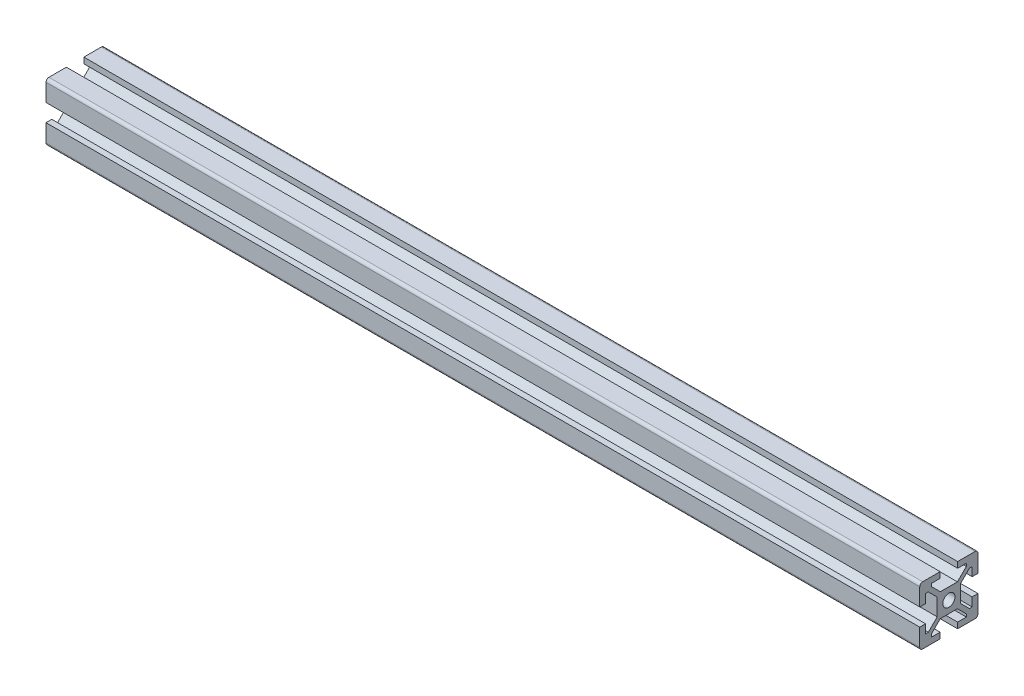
ISO-10303-21;
HEADER;
FILE_DESCRIPTION(('STEP AP214'),'2;1');
FILE_NAME('part.step','',(''),(''),'','','');
FILE_SCHEMA(('AUTOMOTIVE_DESIGN { 1 0 10303 214 1 1 1 1 }'));
ENDSEC;
DATA;
#1=APPLICATION_CONTEXT('core data for automotive mechanical design processes');
#2=APPLICATION_PROTOCOL_DEFINITION('international standard','automotive_design',2000,#1);
#3=PRODUCT_CONTEXT('',#1,'mechanical');
#4=PRODUCT('Part','Part','',(#3));
#5=PRODUCT_RELATED_PRODUCT_CATEGORY('part','',(#4));
#6=PRODUCT_DEFINITION_FORMATION('','',#4);
#7=PRODUCT_DEFINITION_CONTEXT('part definition',#1,'design');
#8=PRODUCT_DEFINITION('design','',#6,#7);
#9=PRODUCT_DEFINITION_SHAPE('','',#8);
#10=(LENGTH_UNIT() NAMED_UNIT(*) SI_UNIT(.MILLI.,.METRE.));
#11=(NAMED_UNIT(*) PLANE_ANGLE_UNIT() SI_UNIT($,.RADIAN.));
#12=(NAMED_UNIT(*) SI_UNIT($,.STERADIAN.) SOLID_ANGLE_UNIT());
#13=UNCERTAINTY_MEASURE_WITH_UNIT(LENGTH_MEASURE(1.E-05),#10,'distance_accuracy_value','');
#14=(GEOMETRIC_REPRESENTATION_CONTEXT(3) GLOBAL_UNCERTAINTY_ASSIGNED_CONTEXT((#13)) GLOBAL_UNIT_ASSIGNED_CONTEXT((#10,
#11,#12)) REPRESENTATION_CONTEXT('',''));
#15=CARTESIAN_POINT('',(0.,0.,0.));
#16=DIRECTION('',(0.,0.,1.));
#17=DIRECTION('',(1.,0.,0.));
#18=AXIS2_PLACEMENT_3D('',#15,#16,#17);
#19=CARTESIAN_POINT('',(300.,9.,9.));
#20=DIRECTION('',(1.,0.,0.));
#21=DIRECTION('',(0.,0.,-1.));
#22=AXIS2_PLACEMENT_3D('',#19,#20,#21);
#23=PLANE('',#22);
#24=CARTESIAN_POINT('',(300.,9.,9.));
#25=DIRECTION('',(1.,0.,0.));
#26=DIRECTION('',(0.,0.,-1.));
#27=AXIS2_PLACEMENT_3D('',#24,#25,#26);
#28=CIRCLE('',#27,1.);
#29=CARTESIAN_POINT('',(300.,10.,9.));
#30=VERTEX_POINT('',#29);
#31=CARTESIAN_POINT('',(300.,9.,10.));
#32=VERTEX_POINT('',#31);
#33=EDGE_CURVE('E474',#30,#32,#28,.T.);
#34=ORIENTED_EDGE('',*,*,#33,.T.);
#35=DIRECTION('',(0.,-1.,0.));
#36=VECTOR('',#35,1.);
#37=CARTESIAN_POINT('',(300.,9.,10.));
#38=LINE('',#37,#36);
#39=CARTESIAN_POINT('',(300.,3.,10.));
#40=VERTEX_POINT('',#39);
#41=EDGE_CURVE('E222',#32,#40,#38,.T.);
#42=ORIENTED_EDGE('',*,*,#41,.T.);
#43=DIRECTION('',(0.,0.,-1.));
#44=VECTOR('',#43,1.);
#45=CARTESIAN_POINT('',(300.,3.,10.));
#46=LINE('',#45,#44);
#47=CARTESIAN_POINT('',(300.,3.,8.));
#48=VERTEX_POINT('',#47);
#49=EDGE_CURVE('E606',#40,#48,#46,.T.);
#50=ORIENTED_EDGE('',*,*,#49,.T.);
#51=DIRECTION('',(0.,1.,0.));
#52=VECTOR('',#51,1.);
#53=CARTESIAN_POINT('',(300.,3.,8.));
#54=LINE('',#53,#52);
#55=CARTESIAN_POINT('',(300.,6.,8.));
#56=VERTEX_POINT('',#55);
#57=EDGE_CURVE('E630',#48,#56,#54,.T.);
#58=ORIENTED_EDGE('',*,*,#57,.T.);
#59=DIRECTION('',(0.,0.,-1.));
#60=VECTOR('',#59,1.);
#61=CARTESIAN_POINT('',(300.,6.,8.));
#62=LINE('',#61,#60);
#63=CARTESIAN_POINT('',(300.,6.,7.06066017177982));
#64=VERTEX_POINT('',#63);
#65=EDGE_CURVE('E621',#56,#64,#62,.T.);
#66=ORIENTED_EDGE('',*,*,#65,.T.);
#67=DIRECTION('',(0.,-0.707106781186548,-0.707106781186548));
#68=VECTOR('',#67,1.);
#69=CARTESIAN_POINT('',(300.,6.,7.06066017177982));
#70=LINE('',#69,#68);
#71=CARTESIAN_POINT('',(300.,2.93933982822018,4.));
#72=VERTEX_POINT('',#71);
#73=EDGE_CURVE('E628',#64,#72,#70,.T.);
#74=ORIENTED_EDGE('',*,*,#73,.T.);
#75=DIRECTION('',(0.,-1.,0.));
#76=VECTOR('',#75,1.);
#77=CARTESIAN_POINT('',(300.,2.93933982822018,4.));
#78=LINE('',#77,#76);
#79=CARTESIAN_POINT('',(300.,-2.93933982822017,4.));
#80=VERTEX_POINT('',#79);
#81=EDGE_CURVE('E627',#72,#80,#78,.T.);
#82=ORIENTED_EDGE('',*,*,#81,.T.);
#83=DIRECTION('',(0.,-0.707106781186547,0.707106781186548));
#84=VECTOR('',#83,1.);
#85=CARTESIAN_POINT('',(300.,-2.93933982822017,4.));
#86=LINE('',#85,#84);
#87=CARTESIAN_POINT('',(300.,-6.,7.06066017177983));
#88=VERTEX_POINT('',#87);
#89=EDGE_CURVE('E634',#80,#88,#86,.T.);
#90=ORIENTED_EDGE('',*,*,#89,.T.);
#91=DIRECTION('',(0.,0.,1.));
#92=VECTOR('',#91,1.);
#93=CARTESIAN_POINT('',(300.,-6.,7.06066017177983));
#94=LINE('',#93,#92);
#95=CARTESIAN_POINT('',(300.,-6.,7.99999999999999));
#96=VERTEX_POINT('',#95);
#97=EDGE_CURVE('E640',#88,#96,#94,.T.);
#98=ORIENTED_EDGE('',*,*,#97,.T.);
#99=DIRECTION('',(0.,1.,0.));
#100=VECTOR('',#99,1.);
#101=CARTESIAN_POINT('',(300.,-6.,7.99999999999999));
#102=LINE('',#101,#100);
#103=CARTESIAN_POINT('',(300.,-3.,7.99999999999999));
#104=VERTEX_POINT('',#103);
#105=EDGE_CURVE('E639',#96,#104,#102,.T.);
#106=ORIENTED_EDGE('',*,*,#105,.T.);
#107=DIRECTION('',(0.,0.,1.));
#108=VECTOR('',#107,1.);
#109=CARTESIAN_POINT('',(300.,-3.,7.99999999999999));
#110=LINE('',#109,#108);
#111=CARTESIAN_POINT('',(300.,-3.,10.));
#112=VERTEX_POINT('',#111);
#113=EDGE_CURVE('E641',#104,#112,#110,.T.);
#114=ORIENTED_EDGE('',*,*,#113,.T.);
#115=DIRECTION('',(0.,-1.,0.));
#116=VECTOR('',#115,1.);
#117=CARTESIAN_POINT('',(300.,-3.,10.));
#118=LINE('',#117,#116);
#119=CARTESIAN_POINT('',(300.,-9.,10.));
#120=VERTEX_POINT('',#119);
#121=EDGE_CURVE('E643',#112,#120,#118,.T.);
#122=ORIENTED_EDGE('',*,*,#121,.T.);
#123=CARTESIAN_POINT('',(300.,-9.,9.));
#124=DIRECTION('',(1.,0.,0.));
#125=DIRECTION('',(0.,0.,-1.));
#126=AXIS2_PLACEMENT_3D('',#123,#124,#125);
#127=CIRCLE('',#126,1.);
#128=CARTESIAN_POINT('',(300.,-10.,9.));
#129=VERTEX_POINT('',#128);
#130=EDGE_CURVE('E644',#120,#129,#127,.T.);
#131=ORIENTED_EDGE('',*,*,#130,.T.);
#132=DIRECTION('',(0.,0.,-1.));
#133=VECTOR('',#132,1.);
#134=CARTESIAN_POINT('',(300.,-10.,9.));
#135=LINE('',#134,#133);
#136=CARTESIAN_POINT('',(300.,-10.,3.));
#137=VERTEX_POINT('',#136);
#138=EDGE_CURVE('E650',#129,#137,#135,.T.);
#139=ORIENTED_EDGE('',*,*,#138,.T.);
#140=DIRECTION('',(0.,1.,0.));
#141=VECTOR('',#140,1.);
#142=CARTESIAN_POINT('',(300.,-10.,3.));
#143=LINE('',#142,#141);
#144=CARTESIAN_POINT('',(300.,-8.,3.));
#145=VERTEX_POINT('',#144);
#146=EDGE_CURVE('E647',#137,#145,#143,.T.);
#147=ORIENTED_EDGE('',*,*,#146,.T.);
#148=DIRECTION('',(0.,0.,1.));
#149=VECTOR('',#148,1.);
#150=CARTESIAN_POINT('',(300.,-8.,3.));
#151=LINE('',#150,#149);
#152=CARTESIAN_POINT('',(300.,-8.,6.));
#153=VERTEX_POINT('',#152);
#154=EDGE_CURVE('E651',#145,#153,#151,.T.);
#155=ORIENTED_EDGE('',*,*,#154,.T.);
#156=DIRECTION('',(0.,1.,0.));
#157=VECTOR('',#156,1.);
#158=CARTESIAN_POINT('',(300.,-8.,6.));
#159=LINE('',#158,#157);
#160=CARTESIAN_POINT('',(300.,-7.06066017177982,6.));
#161=VERTEX_POINT('',#160);
#162=EDGE_CURVE('E652',#153,#161,#159,.T.);
#163=ORIENTED_EDGE('',*,*,#162,.T.);
#164=DIRECTION('',(0.,0.707106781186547,-0.707106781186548));
#165=VECTOR('',#164,1.);
#166=CARTESIAN_POINT('',(300.,-7.06066017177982,6.));
#167=LINE('',#166,#165);
#168=CARTESIAN_POINT('',(300.,-4.,2.93933982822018));
#169=VERTEX_POINT('',#168);
#170=EDGE_CURVE('E654',#161,#169,#167,.T.);
#171=ORIENTED_EDGE('',*,*,#170,.T.);
#172=DIRECTION('',(0.,0.,-1.));
#173=VECTOR('',#172,1.);
#174=CARTESIAN_POINT('',(300.,-4.,2.93933982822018));
#175=LINE('',#174,#173);
#176=CARTESIAN_POINT('',(300.,-4.,-2.93933982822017));
#177=VERTEX_POINT('',#176);
#178=EDGE_CURVE('E660',#169,#177,#175,.T.);
#179=ORIENTED_EDGE('',*,*,#178,.T.);
#180=DIRECTION('',(0.,-0.707106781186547,-0.707106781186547));
#181=VECTOR('',#180,1.);
#182=CARTESIAN_POINT('',(300.,-4.,-2.93933982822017));
#183=LINE('',#182,#181);
#184=CARTESIAN_POINT('',(300.,-7.06066017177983,-6.));
#185=VERTEX_POINT('',#184);
#186=EDGE_CURVE('E656',#177,#185,#183,.T.);
#187=ORIENTED_EDGE('',*,*,#186,.T.);
#188=DIRECTION('',(0.,-1.,0.));
#189=VECTOR('',#188,1.);
#190=CARTESIAN_POINT('',(300.,-7.06066017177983,-6.));
#191=LINE('',#190,#189);
#192=CARTESIAN_POINT('',(300.,-7.99999999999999,-6.));
#193=VERTEX_POINT('',#192);
#194=EDGE_CURVE('E662',#185,#193,#191,.T.);
#195=ORIENTED_EDGE('',*,*,#194,.T.);
#196=DIRECTION('',(0.,0.,1.));
#197=VECTOR('',#196,1.);
#198=CARTESIAN_POINT('',(300.,-7.99999999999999,-6.));
#199=LINE('',#198,#197);
#200=CARTESIAN_POINT('',(300.,-7.99999999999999,-3.));
#201=VERTEX_POINT('',#200);
#202=EDGE_CURVE('E663',#193,#201,#199,.T.);
#203=ORIENTED_EDGE('',*,*,#202,.T.);
#204=DIRECTION('',(0.,-1.,0.));
#205=VECTOR('',#204,1.);
#206=CARTESIAN_POINT('',(300.,-7.99999999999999,-3.));
#207=LINE('',#206,#205);
#208=CARTESIAN_POINT('',(300.,-10.,-3.));
#209=VERTEX_POINT('',#208);
#210=EDGE_CURVE('E661',#201,#209,#207,.T.);
#211=ORIENTED_EDGE('',*,*,#210,.T.);
#212=DIRECTION('',(0.,0.,-1.));
#213=VECTOR('',#212,1.);
#214=CARTESIAN_POINT('',(300.,-10.,-3.));
#215=LINE('',#214,#213);
#216=CARTESIAN_POINT('',(300.,-10.,-9.00000000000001));
#217=VERTEX_POINT('',#216);
#218=EDGE_CURVE('E670',#209,#217,#215,.T.);
#219=ORIENTED_EDGE('',*,*,#218,.T.);
#220=CARTESIAN_POINT('',(300.,-9.,-9.00000000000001));
#221=DIRECTION('',(1.,0.,0.));
#222=DIRECTION('',(0.,0.,-1.));
#223=AXIS2_PLACEMENT_3D('',#220,#221,#222);
#224=CIRCLE('',#223,0.999999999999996);
#225=CARTESIAN_POINT('',(300.,-9.,-10.));
#226=VERTEX_POINT('',#225);
#227=EDGE_CURVE('E667',#217,#226,#224,.T.);
#228=ORIENTED_EDGE('',*,*,#227,.T.);
#229=DIRECTION('',(0.,1.,0.));
#230=VECTOR('',#229,1.);
#231=CARTESIAN_POINT('',(300.,-9.,-10.));
#232=LINE('',#231,#230);
#233=CARTESIAN_POINT('',(300.,-3.,-10.));
#234=VERTEX_POINT('',#233);
#235=EDGE_CURVE('E672',#226,#234,#232,.T.);
#236=ORIENTED_EDGE('',*,*,#235,.T.);
#237=DIRECTION('',(0.,0.,1.));
#238=VECTOR('',#237,1.);
#239=CARTESIAN_POINT('',(300.,-3.,-10.));
#240=LINE('',#239,#238);
#241=CARTESIAN_POINT('',(300.,-3.,-8.00000000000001));
#242=VERTEX_POINT('',#241);
#243=EDGE_CURVE('E674',#234,#242,#240,.T.);
#244=ORIENTED_EDGE('',*,*,#243,.T.);
#245=DIRECTION('',(0.,-1.,0.));
#246=VECTOR('',#245,1.);
#247=CARTESIAN_POINT('',(300.,-3.,-8.00000000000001));
#248=LINE('',#247,#246);
#249=CARTESIAN_POINT('',(300.,-6.,-8.00000000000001));
#250=VERTEX_POINT('',#249);
#251=EDGE_CURVE('E673',#242,#250,#248,.T.);
#252=ORIENTED_EDGE('',*,*,#251,.T.);
#253=DIRECTION('',(0.,0.,1.));
#254=VECTOR('',#253,1.);
#255=CARTESIAN_POINT('',(300.,-6.,-8.00000000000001));
#256=LINE('',#255,#254);
#257=CARTESIAN_POINT('',(300.,-6.,-7.06066017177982));
#258=VERTEX_POINT('',#257);
#259=EDGE_CURVE('E680',#250,#258,#256,.T.);
#260=ORIENTED_EDGE('',*,*,#259,.T.);
#261=DIRECTION('',(0.,0.707106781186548,0.707106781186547));
#262=VECTOR('',#261,1.);
#263=CARTESIAN_POINT('',(300.,-6.,-7.06066017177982));
#264=LINE('',#263,#262);
#265=CARTESIAN_POINT('',(300.,-2.93933982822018,-4.));
#266=VERTEX_POINT('',#265);
#267=EDGE_CURVE('E677',#258,#266,#264,.T.);
#268=ORIENTED_EDGE('',*,*,#267,.T.);
#269=DIRECTION('',(0.,1.,0.));
#270=VECTOR('',#269,1.);
#271=CARTESIAN_POINT('',(300.,-2.93933982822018,-4.));
#272=LINE('',#271,#270);
#273=CARTESIAN_POINT('',(300.,2.93933982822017,-4.));
#274=VERTEX_POINT('',#273);
#275=EDGE_CURVE('E682',#266,#274,#272,.T.);
#276=ORIENTED_EDGE('',*,*,#275,.T.);
#277=DIRECTION('',(0.,0.707106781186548,-0.707106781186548));
#278=VECTOR('',#277,1.);
#279=CARTESIAN_POINT('',(300.,2.93933982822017,-4.));
#280=LINE('',#279,#278);
#281=CARTESIAN_POINT('',(300.,6.,-7.06066017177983));
#282=VERTEX_POINT('',#281);
#283=EDGE_CURVE('E681',#274,#282,#280,.T.);
#284=ORIENTED_EDGE('',*,*,#283,.T.);
#285=DIRECTION('',(0.,0.,-1.));
#286=VECTOR('',#285,1.);
#287=CARTESIAN_POINT('',(300.,6.,-7.06066017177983));
#288=LINE('',#287,#286);
#289=CARTESIAN_POINT('',(300.,6.,-7.99999999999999));
#290=VERTEX_POINT('',#289);
#291=EDGE_CURVE('E683',#282,#290,#288,.T.);
#292=ORIENTED_EDGE('',*,*,#291,.T.);
#293=DIRECTION('',(0.,-1.,0.));
#294=VECTOR('',#293,1.);
#295=CARTESIAN_POINT('',(300.,6.,-7.99999999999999));
#296=LINE('',#295,#294);
#297=CARTESIAN_POINT('',(300.,3.,-7.99999999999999));
#298=VERTEX_POINT('',#297);
#299=EDGE_CURVE('E690',#290,#298,#296,.T.);
#300=ORIENTED_EDGE('',*,*,#299,.T.);
#301=DIRECTION('',(0.,0.,-1.));
#302=VECTOR('',#301,1.);
#303=CARTESIAN_POINT('',(300.,3.,-7.99999999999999));
#304=LINE('',#303,#302);
#305=CARTESIAN_POINT('',(300.,3.,-10.));
#306=VERTEX_POINT('',#305);
#307=EDGE_CURVE('E689',#298,#306,#304,.T.);
#308=ORIENTED_EDGE('',*,*,#307,.T.);
#309=DIRECTION('',(0.,1.,0.));
#310=VECTOR('',#309,1.);
#311=CARTESIAN_POINT('',(300.,3.,-10.));
#312=LINE('',#311,#310);
#313=CARTESIAN_POINT('',(300.,9.,-10.));
#314=VERTEX_POINT('',#313);
#315=EDGE_CURVE('E693',#306,#314,#312,.T.);
#316=ORIENTED_EDGE('',*,*,#315,.T.);
#317=CARTESIAN_POINT('',(300.,9.,-9.00000000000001));
#318=DIRECTION('',(1.,0.,0.));
#319=DIRECTION('',(0.,0.,-1.));
#320=AXIS2_PLACEMENT_3D('',#317,#318,#319);
#321=CIRCLE('',#320,1.);
#322=CARTESIAN_POINT('',(300.,10.,-9.00000000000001));
#323=VERTEX_POINT('',#322);
#324=EDGE_CURVE('E691',#314,#323,#321,.T.);
#325=ORIENTED_EDGE('',*,*,#324,.T.);
#326=DIRECTION('',(0.,0.,1.));
#327=VECTOR('',#326,1.);
#328=CARTESIAN_POINT('',(300.,10.,-9.00000000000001));
#329=LINE('',#328,#327);
#330=CARTESIAN_POINT('',(300.,10.,-3.));
#331=VERTEX_POINT('',#330);
#332=EDGE_CURVE('E694',#323,#331,#329,.T.);
#333=ORIENTED_EDGE('',*,*,#332,.T.);
#334=DIRECTION('',(0.,-1.,0.));
#335=VECTOR('',#334,1.);
#336=CARTESIAN_POINT('',(300.,10.,-3.));
#337=LINE('',#336,#335);
#338=CARTESIAN_POINT('',(300.,8.,-3.));
#339=VERTEX_POINT('',#338);
#340=EDGE_CURVE('E700',#331,#339,#337,.T.);
#341=ORIENTED_EDGE('',*,*,#340,.T.);
#342=DIRECTION('',(0.,0.,-1.));
#343=VECTOR('',#342,1.);
#344=CARTESIAN_POINT('',(300.,8.,-3.));
#345=LINE('',#344,#343);
#346=CARTESIAN_POINT('',(300.,8.,-6.));
#347=VERTEX_POINT('',#346);
#348=EDGE_CURVE('E696',#339,#347,#345,.T.);
#349=ORIENTED_EDGE('',*,*,#348,.T.);
#350=DIRECTION('',(0.,-1.,0.));
#351=VECTOR('',#350,1.);
#352=CARTESIAN_POINT('',(300.,8.,-6.));
#353=LINE('',#352,#351);
#354=CARTESIAN_POINT('',(300.,7.06066017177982,-6.));
#355=VERTEX_POINT('',#354);
#356=EDGE_CURVE('E703',#347,#355,#353,.T.);
#357=ORIENTED_EDGE('',*,*,#356,.T.);
#358=DIRECTION('',(0.,-0.707106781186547,0.707106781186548));
#359=VECTOR('',#358,1.);
#360=CARTESIAN_POINT('',(300.,7.06066017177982,-6.));
#361=LINE('',#360,#359);
#362=CARTESIAN_POINT('',(300.,4.,-2.93933982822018));
#363=VERTEX_POINT('',#362);
#364=EDGE_CURVE('E701',#355,#363,#361,.T.);
#365=ORIENTED_EDGE('',*,*,#364,.T.);
#366=DIRECTION('',(0.,0.,1.));
#367=VECTOR('',#366,1.);
#368=CARTESIAN_POINT('',(300.,4.,-2.93933982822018));
#369=LINE('',#368,#367);
#370=CARTESIAN_POINT('',(300.,4.,2.93933982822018));
#371=VERTEX_POINT('',#370);
#372=EDGE_CURVE('E704',#363,#371,#369,.T.);
#373=ORIENTED_EDGE('',*,*,#372,.T.);
#374=DIRECTION('',(0.,0.707106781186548,0.707106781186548));
#375=VECTOR('',#374,1.);
#376=CARTESIAN_POINT('',(300.,4.,2.93933982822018));
#377=LINE('',#376,#375);
#378=CARTESIAN_POINT('',(300.,7.06066017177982,6.));
#379=VERTEX_POINT('',#378);
#380=EDGE_CURVE('E707',#371,#379,#377,.T.);
#381=ORIENTED_EDGE('',*,*,#380,.T.);
#382=DIRECTION('',(0.,1.,0.));
#383=VECTOR('',#382,1.);
#384=CARTESIAN_POINT('',(300.,7.06066017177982,6.));
#385=LINE('',#384,#383);
#386=CARTESIAN_POINT('',(300.,7.99999999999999,6.));
#387=VERTEX_POINT('',#386);
#388=EDGE_CURVE('E358',#379,#387,#385,.T.);
#389=ORIENTED_EDGE('',*,*,#388,.T.);
#390=DIRECTION('',(0.,0.,-1.));
#391=VECTOR('',#390,1.);
#392=CARTESIAN_POINT('',(300.,7.99999999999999,6.));
#393=LINE('',#392,#391);
#394=CARTESIAN_POINT('',(300.,7.99999999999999,3.));
#395=VERTEX_POINT('',#394);
#396=EDGE_CURVE('E353',#387,#395,#393,.T.);
#397=ORIENTED_EDGE('',*,*,#396,.T.);
#398=DIRECTION('',(0.,1.,0.));
#399=VECTOR('',#398,1.);
#400=CARTESIAN_POINT('',(300.,7.99999999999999,3.));
#401=LINE('',#400,#399);
#402=CARTESIAN_POINT('',(300.,10.,3.));
#403=VERTEX_POINT('',#402);
#404=EDGE_CURVE('E359',#395,#403,#401,.T.);
#405=ORIENTED_EDGE('',*,*,#404,.T.);
#406=DIRECTION('',(0.,0.,1.));
#407=VECTOR('',#406,1.);
#408=CARTESIAN_POINT('',(300.,10.,3.));
#409=LINE('',#408,#407);
#410=EDGE_CURVE('E59',#403,#30,#409,.T.);
#411=ORIENTED_EDGE('',*,*,#410,.T.);
#412=EDGE_LOOP('',(#34,#42,#50,#58,#66,#74,#82,#90,#98,#106,#114,#122,#131,#139,#147,#155,#163,
#171,#179,#187,#195,#203,#211,#219,#228,#236,#244,#252,#260,#268,#276,#284,#292,#300,#308,#316,
#325,#333,#341,#349,#357,#365,#373,#381,#389,#397,#405,#411));
#413=FACE_BOUND('',#412,.T.);
#414=CARTESIAN_POINT('',(300.,0.,0.));
#415=DIRECTION('',(1.,0.,0.));
#416=DIRECTION('',(0.,0.,-1.));
#417=AXIS2_PLACEMENT_3D('',#414,#415,#416);
#418=CIRCLE('',#417,2.1);
#419=CARTESIAN_POINT('',(300.,0.,-2.1));
#420=VERTEX_POINT('',#419);
#421=EDGE_CURVE('E385',#420,#420,#418,.T.);
#422=ORIENTED_EDGE('',*,*,#421,.F.);
#423=EDGE_LOOP('',(#422));
#424=FACE_BOUND('',#423,.T.);
#425=ADVANCED_FACE('F41',(#413,#424),#23,.T.);
#426=CARTESIAN_POINT('',(0.,9.,9.));
#427=DIRECTION('',(1.,0.,0.));
#428=DIRECTION('',(0.,0.,-1.));
#429=AXIS2_PLACEMENT_3D('',#426,#427,#428);
#430=PLANE('',#429);
#431=CARTESIAN_POINT('',(0.,9.,9.));
#432=DIRECTION('',(1.,0.,0.));
#433=DIRECTION('',(0.,0.,-1.));
#434=AXIS2_PLACEMENT_3D('',#431,#432,#433);
#435=CIRCLE('',#434,1.);
#436=CARTESIAN_POINT('',(0.,10.,9.));
#437=VERTEX_POINT('',#436);
#438=CARTESIAN_POINT('',(0.,9.,10.));
#439=VERTEX_POINT('',#438);
#440=EDGE_CURVE('E376',#437,#439,#435,.T.);
#441=ORIENTED_EDGE('',*,*,#440,.F.);
#442=DIRECTION('',(0.,0.,1.));
#443=VECTOR('',#442,1.);
#444=CARTESIAN_POINT('',(0.,10.,3.));
#445=LINE('',#444,#443);
#446=CARTESIAN_POINT('',(0.,10.,3.));
#447=VERTEX_POINT('',#446);
#448=EDGE_CURVE('E213',#447,#437,#445,.T.);
#449=ORIENTED_EDGE('',*,*,#448,.F.);
#450=DIRECTION('',(0.,1.,0.));
#451=VECTOR('',#450,1.);
#452=CARTESIAN_POINT('',(0.,7.99999999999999,3.));
#453=LINE('',#452,#451);
#454=CARTESIAN_POINT('',(0.,7.99999999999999,3.));
#455=VERTEX_POINT('',#454);
#456=EDGE_CURVE('E210',#455,#447,#453,.T.);
#457=ORIENTED_EDGE('',*,*,#456,.F.);
#458=DIRECTION('',(0.,0.,-1.));
#459=VECTOR('',#458,1.);
#460=CARTESIAN_POINT('',(0.,7.99999999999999,6.));
#461=LINE('',#460,#459);
#462=CARTESIAN_POINT('',(0.,7.99999999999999,6.));
#463=VERTEX_POINT('',#462);
#464=EDGE_CURVE('E366',#463,#455,#461,.T.);
#465=ORIENTED_EDGE('',*,*,#464,.F.);
#466=DIRECTION('',(0.,1.,0.));
#467=VECTOR('',#466,1.);
#468=CARTESIAN_POINT('',(0.,7.06066017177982,6.));
#469=LINE('',#468,#467);
#470=CARTESIAN_POINT('',(0.,7.06066017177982,6.));
#471=VERTEX_POINT('',#470);
#472=EDGE_CURVE('E466',#471,#463,#469,.T.);
#473=ORIENTED_EDGE('',*,*,#472,.F.);
#474=DIRECTION('',(0.,0.707106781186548,0.707106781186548));
#475=VECTOR('',#474,1.);
#476=CARTESIAN_POINT('',(0.,4.,2.93933982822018));
#477=LINE('',#476,#475);
#478=CARTESIAN_POINT('',(0.,4.,2.93933982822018));
#479=VERTEX_POINT('',#478);
#480=EDGE_CURVE('E468',#479,#471,#477,.T.);
#481=ORIENTED_EDGE('',*,*,#480,.F.);
#482=DIRECTION('',(0.,0.,1.));
#483=VECTOR('',#482,1.);
#484=CARTESIAN_POINT('',(0.,4.,-2.93933982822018));
#485=LINE('',#484,#483);
#486=CARTESIAN_POINT('',(0.,4.,-2.93933982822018));
#487=VERTEX_POINT('',#486);
#488=EDGE_CURVE('E464',#487,#479,#485,.T.);
#489=ORIENTED_EDGE('',*,*,#488,.F.);
#490=DIRECTION('',(0.,-0.707106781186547,0.707106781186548));
#491=VECTOR('',#490,1.);
#492=CARTESIAN_POINT('',(0.,7.06066017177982,-6.));
#493=LINE('',#492,#491);
#494=CARTESIAN_POINT('',(0.,7.06066017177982,-6.));
#495=VERTEX_POINT('',#494);
#496=EDGE_CURVE('E465',#495,#487,#493,.T.);
#497=ORIENTED_EDGE('',*,*,#496,.F.);
#498=DIRECTION('',(0.,-1.,0.));
#499=VECTOR('',#498,1.);
#500=CARTESIAN_POINT('',(0.,8.,-6.));
#501=LINE('',#500,#499);
#502=CARTESIAN_POINT('',(0.,8.,-6.));
#503=VERTEX_POINT('',#502);
#504=EDGE_CURVE('E458',#503,#495,#501,.T.);
#505=ORIENTED_EDGE('',*,*,#504,.F.);
#506=DIRECTION('',(0.,0.,-1.));
#507=VECTOR('',#506,1.);
#508=CARTESIAN_POINT('',(0.,8.,-3.));
#509=LINE('',#508,#507);
#510=CARTESIAN_POINT('',(0.,8.,-3.));
#511=VERTEX_POINT('',#510);
#512=EDGE_CURVE('E456',#511,#503,#509,.T.);
#513=ORIENTED_EDGE('',*,*,#512,.F.);
#514=DIRECTION('',(0.,-1.,0.));
#515=VECTOR('',#514,1.);
#516=CARTESIAN_POINT('',(0.,10.,-3.));
#517=LINE('',#516,#515);
#518=CARTESIAN_POINT('',(0.,10.,-3.));
#519=VERTEX_POINT('',#518);
#520=EDGE_CURVE('E457',#519,#511,#517,.T.);
#521=ORIENTED_EDGE('',*,*,#520,.F.);
#522=DIRECTION('',(0.,0.,1.));
#523=VECTOR('',#522,1.);
#524=CARTESIAN_POINT('',(0.,10.,-9.00000000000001));
#525=LINE('',#524,#523);
#526=CARTESIAN_POINT('',(0.,10.,-9.00000000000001));
#527=VERTEX_POINT('',#526);
#528=EDGE_CURVE('E452',#527,#519,#525,.T.);
#529=ORIENTED_EDGE('',*,*,#528,.F.);
#530=CARTESIAN_POINT('',(0.,9.,-9.00000000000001));
#531=DIRECTION('',(1.,0.,0.));
#532=DIRECTION('',(0.,0.,-1.));
#533=AXIS2_PLACEMENT_3D('',#530,#531,#532);
#534=CIRCLE('',#533,1.);
#535=CARTESIAN_POINT('',(0.,9.,-10.));
#536=VERTEX_POINT('',#535);
#537=EDGE_CURVE('E455',#536,#527,#534,.T.);
#538=ORIENTED_EDGE('',*,*,#537,.F.);
#539=DIRECTION('',(0.,1.,0.));
#540=VECTOR('',#539,1.);
#541=CARTESIAN_POINT('',(0.,3.,-10.));
#542=LINE('',#541,#540);
#543=CARTESIAN_POINT('',(0.,3.,-10.));
#544=VERTEX_POINT('',#543);
#545=EDGE_CURVE('E448',#544,#536,#542,.T.);
#546=ORIENTED_EDGE('',*,*,#545,.F.);
#547=DIRECTION('',(0.,0.,-1.));
#548=VECTOR('',#547,1.);
#549=CARTESIAN_POINT('',(0.,3.,-7.99999999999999));
#550=LINE('',#549,#548);
#551=CARTESIAN_POINT('',(0.,3.,-7.99999999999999));
#552=VERTEX_POINT('',#551);
#553=EDGE_CURVE('E449',#552,#544,#550,.T.);
#554=ORIENTED_EDGE('',*,*,#553,.F.);
#555=DIRECTION('',(0.,-1.,0.));
#556=VECTOR('',#555,1.);
#557=CARTESIAN_POINT('',(0.,6.,-7.99999999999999));
#558=LINE('',#557,#556);
#559=CARTESIAN_POINT('',(0.,6.,-7.99999999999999));
#560=VERTEX_POINT('',#559);
#561=EDGE_CURVE('E447',#560,#552,#558,.T.);
#562=ORIENTED_EDGE('',*,*,#561,.F.);
#563=DIRECTION('',(0.,0.,-1.));
#564=VECTOR('',#563,1.);
#565=CARTESIAN_POINT('',(0.,6.,-7.06066017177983));
#566=LINE('',#565,#564);
#567=CARTESIAN_POINT('',(0.,6.,-7.06066017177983));
#568=VERTEX_POINT('',#567);
#569=EDGE_CURVE('E442',#568,#560,#566,.T.);
#570=ORIENTED_EDGE('',*,*,#569,.F.);
#571=DIRECTION('',(0.,0.707106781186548,-0.707106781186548));
#572=VECTOR('',#571,1.);
#573=CARTESIAN_POINT('',(0.,2.93933982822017,-4.));
#574=LINE('',#573,#572);
#575=CARTESIAN_POINT('',(0.,2.93933982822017,-4.));
#576=VERTEX_POINT('',#575);
#577=EDGE_CURVE('E445',#576,#568,#574,.T.);
#578=ORIENTED_EDGE('',*,*,#577,.F.);
#579=DIRECTION('',(0.,1.,0.));
#580=VECTOR('',#579,1.);
#581=CARTESIAN_POINT('',(0.,-2.93933982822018,-4.));
#582=LINE('',#581,#580);
#583=CARTESIAN_POINT('',(0.,-2.93933982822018,-4.));
#584=VERTEX_POINT('',#583);
#585=EDGE_CURVE('E436',#584,#576,#582,.T.);
#586=ORIENTED_EDGE('',*,*,#585,.F.);
#587=DIRECTION('',(0.,0.707106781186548,0.707106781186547));
#588=VECTOR('',#587,1.);
#589=CARTESIAN_POINT('',(0.,-6.,-7.06066017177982));
#590=LINE('',#589,#588);
#591=CARTESIAN_POINT('',(0.,-6.,-7.06066017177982));
#592=VERTEX_POINT('',#591);
#593=EDGE_CURVE('E438',#592,#584,#590,.T.);
#594=ORIENTED_EDGE('',*,*,#593,.F.);
#595=DIRECTION('',(0.,0.,1.));
#596=VECTOR('',#595,1.);
#597=CARTESIAN_POINT('',(0.,-6.,-8.00000000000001));
#598=LINE('',#597,#596);
#599=CARTESIAN_POINT('',(0.,-6.,-8.00000000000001));
#600=VERTEX_POINT('',#599);
#601=EDGE_CURVE('E437',#600,#592,#598,.T.);
#602=ORIENTED_EDGE('',*,*,#601,.F.);
#603=DIRECTION('',(0.,-1.,0.));
#604=VECTOR('',#603,1.);
#605=CARTESIAN_POINT('',(0.,-3.,-8.00000000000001));
#606=LINE('',#605,#604);
#607=CARTESIAN_POINT('',(0.,-3.,-8.00000000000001));
#608=VERTEX_POINT('',#607);
#609=EDGE_CURVE('E431',#608,#600,#606,.T.);
#610=ORIENTED_EDGE('',*,*,#609,.F.);
#611=DIRECTION('',(0.,0.,1.));
#612=VECTOR('',#611,1.);
#613=CARTESIAN_POINT('',(0.,-3.,-10.));
#614=LINE('',#613,#612);
#615=CARTESIAN_POINT('',(0.,-3.,-10.));
#616=VERTEX_POINT('',#615);
#617=EDGE_CURVE('E435',#616,#608,#614,.T.);
#618=ORIENTED_EDGE('',*,*,#617,.F.);
#619=DIRECTION('',(0.,1.,0.));
#620=VECTOR('',#619,1.);
#621=CARTESIAN_POINT('',(0.,-9.,-10.));
#622=LINE('',#621,#620);
#623=CARTESIAN_POINT('',(0.,-9.,-10.));
#624=VERTEX_POINT('',#623);
#625=EDGE_CURVE('E429',#624,#616,#622,.T.);
#626=ORIENTED_EDGE('',*,*,#625,.F.);
#627=CARTESIAN_POINT('',(0.,-9.,-9.00000000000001));
#628=DIRECTION('',(1.,0.,0.));
#629=DIRECTION('',(0.,0.,-1.));
#630=AXIS2_PLACEMENT_3D('',#627,#628,#629);
#631=CIRCLE('',#630,0.999999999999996);
#632=CARTESIAN_POINT('',(0.,-10.,-9.00000000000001));
#633=VERTEX_POINT('',#632);
#634=EDGE_CURVE('E427',#633,#624,#631,.T.);
#635=ORIENTED_EDGE('',*,*,#634,.F.);
#636=DIRECTION('',(0.,0.,-1.));
#637=VECTOR('',#636,1.);
#638=CARTESIAN_POINT('',(0.,-10.,-3.));
#639=LINE('',#638,#637);
#640=CARTESIAN_POINT('',(0.,-10.,-3.));
#641=VERTEX_POINT('',#640);
#642=EDGE_CURVE('E426',#641,#633,#639,.T.);
#643=ORIENTED_EDGE('',*,*,#642,.F.);
#644=DIRECTION('',(0.,-1.,0.));
#645=VECTOR('',#644,1.);
#646=CARTESIAN_POINT('',(0.,-7.99999999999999,-3.));
#647=LINE('',#646,#645);
#648=CARTESIAN_POINT('',(0.,-7.99999999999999,-3.));
#649=VERTEX_POINT('',#648);
#650=EDGE_CURVE('E422',#649,#641,#647,.T.);
#651=ORIENTED_EDGE('',*,*,#650,.F.);
#652=DIRECTION('',(0.,0.,1.));
#653=VECTOR('',#652,1.);
#654=CARTESIAN_POINT('',(0.,-7.99999999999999,-6.));
#655=LINE('',#654,#653);
#656=CARTESIAN_POINT('',(0.,-7.99999999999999,-6.));
#657=VERTEX_POINT('',#656);
#658=EDGE_CURVE('E425',#657,#649,#655,.T.);
#659=ORIENTED_EDGE('',*,*,#658,.F.);
#660=DIRECTION('',(0.,-1.,0.));
#661=VECTOR('',#660,1.);
#662=CARTESIAN_POINT('',(0.,-7.06066017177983,-6.));
#663=LINE('',#662,#661);
#664=CARTESIAN_POINT('',(0.,-7.06066017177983,-6.));
#665=VERTEX_POINT('',#664);
#666=EDGE_CURVE('E419',#665,#657,#663,.T.);
#667=ORIENTED_EDGE('',*,*,#666,.F.);
#668=DIRECTION('',(0.,-0.707106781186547,-0.707106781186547));
#669=VECTOR('',#668,1.);
#670=CARTESIAN_POINT('',(0.,-4.,-2.93933982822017));
#671=LINE('',#670,#669);
#672=CARTESIAN_POINT('',(0.,-4.,-2.93933982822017));
#673=VERTEX_POINT('',#672);
#674=EDGE_CURVE('E418',#673,#665,#671,.T.);
#675=ORIENTED_EDGE('',*,*,#674,.F.);
#676=DIRECTION('',(0.,0.,-1.));
#677=VECTOR('',#676,1.);
#678=CARTESIAN_POINT('',(0.,-4.,2.93933982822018));
#679=LINE('',#678,#677);
#680=CARTESIAN_POINT('',(0.,-4.,2.93933982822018));
#681=VERTEX_POINT('',#680);
#682=EDGE_CURVE('E416',#681,#673,#679,.T.);
#683=ORIENTED_EDGE('',*,*,#682,.F.);
#684=DIRECTION('',(0.,0.707106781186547,-0.707106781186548));
#685=VECTOR('',#684,1.);
#686=CARTESIAN_POINT('',(0.,-7.06066017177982,6.));
#687=LINE('',#686,#685);
#688=CARTESIAN_POINT('',(0.,-7.06066017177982,6.));
#689=VERTEX_POINT('',#688);
#690=EDGE_CURVE('E414',#689,#681,#687,.T.);
#691=ORIENTED_EDGE('',*,*,#690,.F.);
#692=DIRECTION('',(0.,1.,0.));
#693=VECTOR('',#692,1.);
#694=CARTESIAN_POINT('',(0.,-8.,6.));
#695=LINE('',#694,#693);
#696=CARTESIAN_POINT('',(0.,-8.,6.));
#697=VERTEX_POINT('',#696);
#698=EDGE_CURVE('E415',#697,#689,#695,.T.);
#699=ORIENTED_EDGE('',*,*,#698,.F.);
#700=DIRECTION('',(0.,0.,1.));
#701=VECTOR('',#700,1.);
#702=CARTESIAN_POINT('',(0.,-8.,3.));
#703=LINE('',#702,#701);
#704=CARTESIAN_POINT('',(0.,-8.,3.));
#705=VERTEX_POINT('',#704);
#706=EDGE_CURVE('E409',#705,#697,#703,.T.);
#707=ORIENTED_EDGE('',*,*,#706,.F.);
#708=DIRECTION('',(0.,1.,0.));
#709=VECTOR('',#708,1.);
#710=CARTESIAN_POINT('',(0.,-10.,3.));
#711=LINE('',#710,#709);
#712=CARTESIAN_POINT('',(0.,-10.,3.));
#713=VERTEX_POINT('',#712);
#714=EDGE_CURVE('E406',#713,#705,#711,.T.);
#715=ORIENTED_EDGE('',*,*,#714,.F.);
#716=DIRECTION('',(0.,0.,-1.));
#717=VECTOR('',#716,1.);
#718=CARTESIAN_POINT('',(0.,-10.,9.));
#719=LINE('',#718,#717);
#720=CARTESIAN_POINT('',(0.,-10.,9.));
#721=VERTEX_POINT('',#720);
#722=EDGE_CURVE('E408',#721,#713,#719,.T.);
#723=ORIENTED_EDGE('',*,*,#722,.F.);
#724=CARTESIAN_POINT('',(0.,-9.,9.));
#725=DIRECTION('',(1.,0.,0.));
#726=DIRECTION('',(0.,0.,-1.));
#727=AXIS2_PLACEMENT_3D('',#724,#725,#726);
#728=CIRCLE('',#727,1.);
#729=CARTESIAN_POINT('',(0.,-9.,10.));
#730=VERTEX_POINT('',#729);
#731=EDGE_CURVE('E402',#730,#721,#728,.T.);
#732=ORIENTED_EDGE('',*,*,#731,.F.);
#733=DIRECTION('',(0.,-1.,0.));
#734=VECTOR('',#733,1.);
#735=CARTESIAN_POINT('',(0.,-3.,10.));
#736=LINE('',#735,#734);
#737=CARTESIAN_POINT('',(0.,-3.,10.));
#738=VERTEX_POINT('',#737);
#739=EDGE_CURVE('E405',#738,#730,#736,.T.);
#740=ORIENTED_EDGE('',*,*,#739,.F.);
#741=DIRECTION('',(0.,0.,1.));
#742=VECTOR('',#741,1.);
#743=CARTESIAN_POINT('',(0.,-3.,7.99999999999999));
#744=LINE('',#743,#742);
#745=CARTESIAN_POINT('',(0.,-3.,7.99999999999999));
#746=VERTEX_POINT('',#745);
#747=EDGE_CURVE('E398',#746,#738,#744,.T.);
#748=ORIENTED_EDGE('',*,*,#747,.F.);
#749=DIRECTION('',(0.,1.,0.));
#750=VECTOR('',#749,1.);
#751=CARTESIAN_POINT('',(0.,-6.,7.99999999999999));
#752=LINE('',#751,#750);
#753=CARTESIAN_POINT('',(0.,-6.,7.99999999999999));
#754=VERTEX_POINT('',#753);
#755=EDGE_CURVE('E399',#754,#746,#752,.T.);
#756=ORIENTED_EDGE('',*,*,#755,.F.);
#757=DIRECTION('',(0.,0.,1.));
#758=VECTOR('',#757,1.);
#759=CARTESIAN_POINT('',(0.,-6.,7.06066017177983));
#760=LINE('',#759,#758);
#761=CARTESIAN_POINT('',(0.,-6.,7.06066017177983));
#762=VERTEX_POINT('',#761);
#763=EDGE_CURVE('E397',#762,#754,#760,.T.);
#764=ORIENTED_EDGE('',*,*,#763,.F.);
#765=DIRECTION('',(0.,-0.707106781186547,0.707106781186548));
#766=VECTOR('',#765,1.);
#767=CARTESIAN_POINT('',(0.,-2.93933982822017,4.));
#768=LINE('',#767,#766);
#769=CARTESIAN_POINT('',(0.,-2.93933982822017,4.));
#770=VERTEX_POINT('',#769);
#771=EDGE_CURVE('E392',#770,#762,#768,.T.);
#772=ORIENTED_EDGE('',*,*,#771,.F.);
#773=DIRECTION('',(0.,-1.,0.));
#774=VECTOR('',#773,1.);
#775=CARTESIAN_POINT('',(0.,2.93933982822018,4.));
#776=LINE('',#775,#774);
#777=CARTESIAN_POINT('',(0.,2.93933982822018,4.));
#778=VERTEX_POINT('',#777);
#779=EDGE_CURVE('E395',#778,#770,#776,.T.);
#780=ORIENTED_EDGE('',*,*,#779,.F.);
#781=DIRECTION('',(0.,-0.707106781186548,-0.707106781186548));
#782=VECTOR('',#781,1.);
#783=CARTESIAN_POINT('',(0.,6.,7.06066017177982));
#784=LINE('',#783,#782);
#785=CARTESIAN_POINT('',(0.,6.,7.06066017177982));
#786=VERTEX_POINT('',#785);
#787=EDGE_CURVE('E386',#786,#778,#784,.T.);
#788=ORIENTED_EDGE('',*,*,#787,.F.);
#789=DIRECTION('',(0.,0.,-1.));
#790=VECTOR('',#789,1.);
#791=CARTESIAN_POINT('',(0.,6.,8.));
#792=LINE('',#791,#790);
#793=CARTESIAN_POINT('',(0.,6.,8.));
#794=VERTEX_POINT('',#793);
#795=EDGE_CURVE('E388',#794,#786,#792,.T.);
#796=ORIENTED_EDGE('',*,*,#795,.F.);
#797=DIRECTION('',(0.,1.,0.));
#798=VECTOR('',#797,1.);
#799=CARTESIAN_POINT('',(0.,3.,8.));
#800=LINE('',#799,#798);
#801=CARTESIAN_POINT('',(0.,3.,8.));
#802=VERTEX_POINT('',#801);
#803=EDGE_CURVE('E387',#802,#794,#800,.T.);
#804=ORIENTED_EDGE('',*,*,#803,.F.);
#805=DIRECTION('',(0.,0.,-1.));
#806=VECTOR('',#805,1.);
#807=CARTESIAN_POINT('',(0.,3.,10.));
#808=LINE('',#807,#806);
#809=CARTESIAN_POINT('',(0.,3.,10.));
#810=VERTEX_POINT('',#809);
#811=EDGE_CURVE('E384',#810,#802,#808,.T.);
#812=ORIENTED_EDGE('',*,*,#811,.F.);
#813=DIRECTION('',(0.,-1.,0.));
#814=VECTOR('',#813,1.);
#815=CARTESIAN_POINT('',(0.,9.,10.));
#816=LINE('',#815,#814);
#817=EDGE_CURVE('E382',#439,#810,#816,.T.);
#818=ORIENTED_EDGE('',*,*,#817,.F.);
#819=EDGE_LOOP('',(#441,#449,#457,#465,#473,#481,#489,#497,#505,#513,#521,#529,#538,#546,#554,
#562,#570,#578,#586,#594,#602,#610,#618,#626,#635,#643,#651,#659,#667,#675,#683,#691,#699,#707,
#715,#723,#732,#740,#748,#756,#764,#772,#780,#788,#796,#804,#812,#818));
#820=FACE_BOUND('',#819,.T.);
#821=CARTESIAN_POINT('',(0.,0.,0.));
#822=DIRECTION('',(1.,0.,0.));
#823=DIRECTION('',(0.,0.,-1.));
#824=AXIS2_PLACEMENT_3D('',#821,#822,#823);
#825=CIRCLE('',#824,2.1);
#826=CARTESIAN_POINT('',(0.,0.,-2.1));
#827=VERTEX_POINT('',#826);
#828=EDGE_CURVE('E1336',#827,#827,#825,.T.);
#829=ORIENTED_EDGE('',*,*,#828,.T.);
#830=EDGE_LOOP('',(#829));
#831=FACE_BOUND('',#830,.T.);
#832=ADVANCED_FACE('F615',(#820,#831),#430,.F.);
#833=CARTESIAN_POINT('',(300.,9.,9.));
#834=DIRECTION('',(-1.,0.,0.));
#835=DIRECTION('',(0.,0.,1.));
#836=AXIS2_PLACEMENT_3D('',#833,#834,#835);
#837=CYLINDRICAL_SURFACE('',#836,1.);
#838=ORIENTED_EDGE('',*,*,#440,.T.);
#839=DIRECTION('',(-1.,0.,0.));
#840=VECTOR('',#839,1.);
#841=CARTESIAN_POINT('',(300.,9.,10.));
#842=LINE('',#841,#840);
#843=EDGE_CURVE('E11',#32,#439,#842,.T.);
#844=ORIENTED_EDGE('',*,*,#843,.F.);
#845=ORIENTED_EDGE('',*,*,#33,.F.);
#846=DIRECTION('',(-1.,0.,0.));
#847=VECTOR('',#846,1.);
#848=CARTESIAN_POINT('',(300.,10.,9.));
#849=LINE('',#848,#847);
#850=EDGE_CURVE('E371',#30,#437,#849,.T.);
#851=ORIENTED_EDGE('',*,*,#850,.T.);
#852=EDGE_LOOP('',(#838,#844,#845,#851));
#853=FACE_BOUND('',#852,.T.);
#854=ADVANCED_FACE('F43',(#853),#837,.T.);
#855=CARTESIAN_POINT('',(300.,9.,10.));
#856=DIRECTION('',(0.,0.,-1.));
#857=DIRECTION('',(-1.,0.,0.));
#858=AXIS2_PLACEMENT_3D('',#855,#856,#857);
#859=PLANE('',#858);
#860=ORIENTED_EDGE('',*,*,#817,.T.);
#861=DIRECTION('',(-1.,0.,0.));
#862=VECTOR('',#861,1.);
#863=CARTESIAN_POINT('',(300.,3.,10.));
#864=LINE('',#863,#862);
#865=EDGE_CURVE('E49',#40,#810,#864,.T.);
#866=ORIENTED_EDGE('',*,*,#865,.F.);
#867=ORIENTED_EDGE('',*,*,#41,.F.);
#868=ORIENTED_EDGE('',*,*,#843,.T.);
#869=EDGE_LOOP('',(#860,#866,#867,#868));
#870=FACE_BOUND('',#869,.T.);
#871=ADVANCED_FACE('F745',(#870),#859,.F.);
#872=CARTESIAN_POINT('',(300.,3.,10.));
#873=DIRECTION('',(0.,1.,0.));
#874=DIRECTION('',(0.,0.,1.));
#875=AXIS2_PLACEMENT_3D('',#872,#873,#874);
#876=PLANE('',#875);
#877=ORIENTED_EDGE('',*,*,#811,.T.);
#878=DIRECTION('',(-1.,0.,0.));
#879=VECTOR('',#878,1.);
#880=CARTESIAN_POINT('',(300.,3.,8.));
#881=LINE('',#880,#879);
#882=EDGE_CURVE('E598',#48,#802,#881,.T.);
#883=ORIENTED_EDGE('',*,*,#882,.F.);
#884=ORIENTED_EDGE('',*,*,#49,.F.);
#885=ORIENTED_EDGE('',*,*,#865,.T.);
#886=EDGE_LOOP('',(#877,#883,#884,#885));
#887=FACE_BOUND('',#886,.T.);
#888=ADVANCED_FACE('F607',(#887),#876,.F.);
#889=CARTESIAN_POINT('',(300.,3.,8.));
#890=DIRECTION('',(0.,0.,1.));
#891=DIRECTION('',(1.,0.,0.));
#892=AXIS2_PLACEMENT_3D('',#889,#890,#891);
#893=PLANE('',#892);
#894=ORIENTED_EDGE('',*,*,#803,.T.);
#895=DIRECTION('',(-1.,0.,0.));
#896=VECTOR('',#895,1.);
#897=CARTESIAN_POINT('',(300.,6.,8.));
#898=LINE('',#897,#896);
#899=EDGE_CURVE('E600',#56,#794,#898,.T.);
#900=ORIENTED_EDGE('',*,*,#899,.F.);
#901=ORIENTED_EDGE('',*,*,#57,.F.);
#902=ORIENTED_EDGE('',*,*,#882,.T.);
#903=EDGE_LOOP('',(#894,#900,#901,#902));
#904=FACE_BOUND('',#903,.T.);
#905=ADVANCED_FACE('F616',(#904),#893,.F.);
#906=CARTESIAN_POINT('',(300.,6.,8.));
#907=DIRECTION('',(0.,1.,0.));
#908=DIRECTION('',(0.,0.,1.));
#909=AXIS2_PLACEMENT_3D('',#906,#907,#908);
#910=PLANE('',#909);
#911=ORIENTED_EDGE('',*,*,#795,.T.);
#912=DIRECTION('',(-1.,0.,0.));
#913=VECTOR('',#912,1.);
#914=CARTESIAN_POINT('',(300.,6.,7.06066017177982));
#915=LINE('',#914,#913);
#916=EDGE_CURVE('E592',#64,#786,#915,.T.);
#917=ORIENTED_EDGE('',*,*,#916,.F.);
#918=ORIENTED_EDGE('',*,*,#65,.F.);
#919=ORIENTED_EDGE('',*,*,#899,.T.);
#920=EDGE_LOOP('',(#911,#917,#918,#919));
#921=FACE_BOUND('',#920,.T.);
#922=ADVANCED_FACE('F625',(#921),#910,.F.);
#923=CARTESIAN_POINT('',(300.,6.,7.06066017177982));
#924=DIRECTION('',(0.,0.707106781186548,-0.707106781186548));
#925=DIRECTION('',(0.,0.707106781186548,0.707106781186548));
#926=AXIS2_PLACEMENT_3D('',#923,#924,#925);
#927=PLANE('',#926);
#928=ORIENTED_EDGE('',*,*,#787,.T.);
#929=DIRECTION('',(-1.,0.,0.));
#930=VECTOR('',#929,1.);
#931=CARTESIAN_POINT('',(300.,2.93933982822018,4.));
#932=LINE('',#931,#930);
#933=EDGE_CURVE('E593',#72,#778,#932,.T.);
#934=ORIENTED_EDGE('',*,*,#933,.F.);
#935=ORIENTED_EDGE('',*,*,#73,.F.);
#936=ORIENTED_EDGE('',*,*,#916,.T.);
#937=EDGE_LOOP('',(#928,#934,#935,#936));
#938=FACE_BOUND('',#937,.T.);
#939=ADVANCED_FACE('F754',(#938),#927,.F.);
#940=CARTESIAN_POINT('',(300.,2.93933982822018,4.));
#941=DIRECTION('',(0.,0.,-1.));
#942=DIRECTION('',(-1.,0.,0.));
#943=AXIS2_PLACEMENT_3D('',#940,#941,#942);
#944=PLANE('',#943);
#945=ORIENTED_EDGE('',*,*,#779,.T.);
#946=DIRECTION('',(-1.,0.,0.));
#947=VECTOR('',#946,1.);
#948=CARTESIAN_POINT('',(300.,-2.93933982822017,4.));
#949=LINE('',#948,#947);
#950=EDGE_CURVE('E588',#80,#770,#949,.T.);
#951=ORIENTED_EDGE('',*,*,#950,.F.);
#952=ORIENTED_EDGE('',*,*,#81,.F.);
#953=ORIENTED_EDGE('',*,*,#933,.T.);
#954=EDGE_LOOP('',(#945,#951,#952,#953));
#955=FACE_BOUND('',#954,.T.);
#956=ADVANCED_FACE('F756',(#955),#944,.F.);
#957=CARTESIAN_POINT('',(300.,-2.93933982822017,4.));
#958=DIRECTION('',(0.,-0.707106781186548,-0.707106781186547));
#959=DIRECTION('',(0.,0.707106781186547,-0.707106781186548));
#960=AXIS2_PLACEMENT_3D('',#957,#958,#959);
#961=PLANE('',#960);
#962=ORIENTED_EDGE('',*,*,#771,.T.);
#963=DIRECTION('',(-1.,0.,0.));
#964=VECTOR('',#963,1.);
#965=CARTESIAN_POINT('',(300.,-6.,7.06066017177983));
#966=LINE('',#965,#964);
#967=EDGE_CURVE('E583',#88,#762,#966,.T.);
#968=ORIENTED_EDGE('',*,*,#967,.F.);
#969=ORIENTED_EDGE('',*,*,#89,.F.);
#970=ORIENTED_EDGE('',*,*,#950,.T.);
#971=EDGE_LOOP('',(#962,#968,#969,#970));
#972=FACE_BOUND('',#971,.T.);
#973=ADVANCED_FACE('F765',(#972),#961,.F.);
#974=CARTESIAN_POINT('',(300.,-6.,7.06066017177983));
#975=DIRECTION('',(0.,-1.,0.));
#976=DIRECTION('',(0.,0.,-1.));
#977=AXIS2_PLACEMENT_3D('',#974,#975,#976);
#978=PLANE('',#977);
#979=ORIENTED_EDGE('',*,*,#763,.T.);
#980=DIRECTION('',(-1.,0.,0.));
#981=VECTOR('',#980,1.);
#982=CARTESIAN_POINT('',(300.,-6.,7.99999999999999));
#983=LINE('',#982,#981);
#984=EDGE_CURVE('E585',#96,#754,#983,.T.);
#985=ORIENTED_EDGE('',*,*,#984,.F.);
#986=ORIENTED_EDGE('',*,*,#97,.F.);
#987=ORIENTED_EDGE('',*,*,#967,.T.);
#988=EDGE_LOOP('',(#979,#985,#986,#987));
#989=FACE_BOUND('',#988,.T.);
#990=ADVANCED_FACE('F768',(#989),#978,.F.);
#991=CARTESIAN_POINT('',(300.,-6.,7.99999999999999));
#992=DIRECTION('',(0.,0.,1.));
#993=DIRECTION('',(1.,0.,0.));
#994=AXIS2_PLACEMENT_3D('',#991,#992,#993);
#995=PLANE('',#994);
#996=ORIENTED_EDGE('',*,*,#755,.T.);
#997=DIRECTION('',(-1.,0.,0.));
#998=VECTOR('',#997,1.);
#999=CARTESIAN_POINT('',(300.,-3.,7.99999999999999));
#1000=LINE('',#999,#998);
#1001=EDGE_CURVE('E578',#104,#746,#1000,.T.);
#1002=ORIENTED_EDGE('',*,*,#1001,.F.);
#1003=ORIENTED_EDGE('',*,*,#105,.F.);
#1004=ORIENTED_EDGE('',*,*,#984,.T.);
#1005=EDGE_LOOP('',(#996,#1002,#1003,#1004));
#1006=FACE_BOUND('',#1005,.T.);
#1007=ADVANCED_FACE('F769',(#1006),#995,.F.);
#1008=CARTESIAN_POINT('',(300.,-3.,7.99999999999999));
#1009=DIRECTION('',(0.,-1.,0.));
#1010=DIRECTION('',(0.,0.,-1.));
#1011=AXIS2_PLACEMENT_3D('',#1008,#1009,#1010);
#1012=PLANE('',#1011);
#1013=ORIENTED_EDGE('',*,*,#747,.T.);
#1014=DIRECTION('',(-1.,0.,0.));
#1015=VECTOR('',#1014,1.);
#1016=CARTESIAN_POINT('',(300.,-3.,10.));
#1017=LINE('',#1016,#1015);
#1018=EDGE_CURVE('E576',#112,#738,#1017,.T.);
#1019=ORIENTED_EDGE('',*,*,#1018,.F.);
#1020=ORIENTED_EDGE('',*,*,#113,.F.);
#1021=ORIENTED_EDGE('',*,*,#1001,.T.);
#1022=EDGE_LOOP('',(#1013,#1019,#1020,#1021));
#1023=FACE_BOUND('',#1022,.T.);
#1024=ADVANCED_FACE('F771',(#1023),#1012,.F.);
#1025=CARTESIAN_POINT('',(300.,-3.,10.));
#1026=DIRECTION('',(0.,0.,-1.));
#1027=DIRECTION('',(-1.,0.,0.));
#1028=AXIS2_PLACEMENT_3D('',#1025,#1026,#1027);
#1029=PLANE('',#1028);
#1030=ORIENTED_EDGE('',*,*,#739,.T.);
#1031=DIRECTION('',(-1.,0.,0.));
#1032=VECTOR('',#1031,1.);
#1033=CARTESIAN_POINT('',(300.,-9.,10.));
#1034=LINE('',#1033,#1032);
#1035=EDGE_CURVE('E573',#120,#730,#1034,.T.);
#1036=ORIENTED_EDGE('',*,*,#1035,.F.);
#1037=ORIENTED_EDGE('',*,*,#121,.F.);
#1038=ORIENTED_EDGE('',*,*,#1018,.T.);
#1039=EDGE_LOOP('',(#1030,#1036,#1037,#1038));
#1040=FACE_BOUND('',#1039,.T.);
#1041=ADVANCED_FACE('F776',(#1040),#1029,.F.);
#1042=CARTESIAN_POINT('',(300.,-9.,9.));
#1043=DIRECTION('',(-1.,0.,0.));
#1044=DIRECTION('',(0.,0.,1.));
#1045=AXIS2_PLACEMENT_3D('',#1042,#1043,#1044);
#1046=CYLINDRICAL_SURFACE('',#1045,1.);
#1047=ORIENTED_EDGE('',*,*,#731,.T.);
#1048=DIRECTION('',(-1.,0.,0.));
#1049=VECTOR('',#1048,1.);
#1050=CARTESIAN_POINT('',(300.,-10.,9.));
#1051=LINE('',#1050,#1049);
#1052=EDGE_CURVE('E569',#129,#721,#1051,.T.);
#1053=ORIENTED_EDGE('',*,*,#1052,.F.);
#1054=ORIENTED_EDGE('',*,*,#130,.F.);
#1055=ORIENTED_EDGE('',*,*,#1035,.T.);
#1056=EDGE_LOOP('',(#1047,#1053,#1054,#1055));
#1057=FACE_BOUND('',#1056,.T.);
#1058=ADVANCED_FACE('F782',(#1057),#1046,.T.);
#1059=CARTESIAN_POINT('',(300.,-10.,9.));
#1060=DIRECTION('',(0.,1.,0.));
#1061=DIRECTION('',(0.,0.,1.));
#1062=AXIS2_PLACEMENT_3D('',#1059,#1060,#1061);
#1063=PLANE('',#1062);
#1064=ORIENTED_EDGE('',*,*,#722,.T.);
#1065=DIRECTION('',(-1.,0.,0.));
#1066=VECTOR('',#1065,1.);
#1067=CARTESIAN_POINT('',(300.,-10.,3.));
#1068=LINE('',#1067,#1066);
#1069=EDGE_CURVE('E570',#137,#713,#1068,.T.);
#1070=ORIENTED_EDGE('',*,*,#1069,.F.);
#1071=ORIENTED_EDGE('',*,*,#138,.F.);
#1072=ORIENTED_EDGE('',*,*,#1052,.T.);
#1073=EDGE_LOOP('',(#1064,#1070,#1071,#1072));
#1074=FACE_BOUND('',#1073,.T.);
#1075=ADVANCED_FACE('F788',(#1074),#1063,.F.);
#1076=CARTESIAN_POINT('',(300.,-10.,3.));
#1077=DIRECTION('',(0.,0.,1.));
#1078=DIRECTION('',(1.,0.,0.));
#1079=AXIS2_PLACEMENT_3D('',#1076,#1077,#1078);
#1080=PLANE('',#1079);
#1081=ORIENTED_EDGE('',*,*,#714,.T.);
#1082=DIRECTION('',(-1.,0.,0.));
#1083=VECTOR('',#1082,1.);
#1084=CARTESIAN_POINT('',(300.,-8.,3.));
#1085=LINE('',#1084,#1083);
#1086=EDGE_CURVE('E564',#145,#705,#1085,.T.);
#1087=ORIENTED_EDGE('',*,*,#1086,.F.);
#1088=ORIENTED_EDGE('',*,*,#146,.F.);
#1089=ORIENTED_EDGE('',*,*,#1069,.T.);
#1090=EDGE_LOOP('',(#1081,#1087,#1088,#1089));
#1091=FACE_BOUND('',#1090,.T.);
#1092=ADVANCED_FACE('F787',(#1091),#1080,.F.);
#1093=CARTESIAN_POINT('',(300.,-8.,3.));
#1094=DIRECTION('',(0.,-1.,0.));
#1095=DIRECTION('',(0.,0.,-1.));
#1096=AXIS2_PLACEMENT_3D('',#1093,#1094,#1095);
#1097=PLANE('',#1096);
#1098=ORIENTED_EDGE('',*,*,#706,.T.);
#1099=DIRECTION('',(-1.,0.,0.));
#1100=VECTOR('',#1099,1.);
#1101=CARTESIAN_POINT('',(300.,-8.,6.));
#1102=LINE('',#1101,#1100);
#1103=EDGE_CURVE('E563',#153,#697,#1102,.T.);
#1104=ORIENTED_EDGE('',*,*,#1103,.F.);
#1105=ORIENTED_EDGE('',*,*,#154,.F.);
#1106=ORIENTED_EDGE('',*,*,#1086,.T.);
#1107=EDGE_LOOP('',(#1098,#1104,#1105,#1106));
#1108=FACE_BOUND('',#1107,.T.);
#1109=ADVANCED_FACE('F792',(#1108),#1097,.F.);
#1110=CARTESIAN_POINT('',(300.,-8.,6.));
#1111=DIRECTION('',(0.,0.,1.));
#1112=DIRECTION('',(1.,0.,0.));
#1113=AXIS2_PLACEMENT_3D('',#1110,#1111,#1112);
#1114=PLANE('',#1113);
#1115=ORIENTED_EDGE('',*,*,#698,.T.);
#1116=DIRECTION('',(-1.,0.,0.));
#1117=VECTOR('',#1116,1.);
#1118=CARTESIAN_POINT('',(300.,-7.06066017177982,6.));
#1119=LINE('',#1118,#1117);
#1120=EDGE_CURVE('E556',#161,#689,#1119,.T.);
#1121=ORIENTED_EDGE('',*,*,#1120,.F.);
#1122=ORIENTED_EDGE('',*,*,#162,.F.);
#1123=ORIENTED_EDGE('',*,*,#1103,.T.);
#1124=EDGE_LOOP('',(#1115,#1121,#1122,#1123));
#1125=FACE_BOUND('',#1124,.T.);
#1126=ADVANCED_FACE('F798',(#1125),#1114,.F.);
#1127=CARTESIAN_POINT('',(300.,-7.06066017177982,6.));
#1128=DIRECTION('',(0.,0.707106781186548,0.707106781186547));
#1129=DIRECTION('',(0.,-0.707106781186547,0.707106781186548));
#1130=AXIS2_PLACEMENT_3D('',#1127,#1128,#1129);
#1131=PLANE('',#1130);
#1132=ORIENTED_EDGE('',*,*,#690,.T.);
#1133=DIRECTION('',(-1.,0.,0.));
#1134=VECTOR('',#1133,1.);
#1135=CARTESIAN_POINT('',(300.,-4.,2.93933982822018));
#1136=LINE('',#1135,#1134);
#1137=EDGE_CURVE('E554',#169,#681,#1136,.T.);
#1138=ORIENTED_EDGE('',*,*,#1137,.F.);
#1139=ORIENTED_EDGE('',*,*,#170,.F.);
#1140=ORIENTED_EDGE('',*,*,#1120,.T.);
#1141=EDGE_LOOP('',(#1132,#1138,#1139,#1140));
#1142=FACE_BOUND('',#1141,.T.);
#1143=ADVANCED_FACE('F805',(#1142),#1131,.F.);
#1144=CARTESIAN_POINT('',(300.,-4.,2.93933982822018));
#1145=DIRECTION('',(0.,1.,0.));
#1146=DIRECTION('',(0.,0.,1.));
#1147=AXIS2_PLACEMENT_3D('',#1144,#1145,#1146);
#1148=PLANE('',#1147);
#1149=ORIENTED_EDGE('',*,*,#682,.T.);
#1150=DIRECTION('',(-1.,0.,0.));
#1151=VECTOR('',#1150,1.);
#1152=CARTESIAN_POINT('',(300.,-4.,-2.93933982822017));
#1153=LINE('',#1152,#1151);
#1154=EDGE_CURVE('E555',#177,#673,#1153,.T.);
#1155=ORIENTED_EDGE('',*,*,#1154,.F.);
#1156=ORIENTED_EDGE('',*,*,#178,.F.);
#1157=ORIENTED_EDGE('',*,*,#1137,.T.);
#1158=EDGE_LOOP('',(#1149,#1155,#1156,#1157));
#1159=FACE_BOUND('',#1158,.T.);
#1160=ADVANCED_FACE('F807',(#1159),#1148,.F.);
#1161=CARTESIAN_POINT('',(300.,-4.,-2.93933982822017));
#1162=DIRECTION('',(0.,0.707106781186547,-0.707106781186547));
#1163=DIRECTION('',(0.,0.707106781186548,0.707106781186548));
#1164=AXIS2_PLACEMENT_3D('',#1161,#1162,#1163);
#1165=PLANE('',#1164);
#1166=ORIENTED_EDGE('',*,*,#674,.T.);
#1167=DIRECTION('',(-1.,0.,0.));
#1168=VECTOR('',#1167,1.);
#1169=CARTESIAN_POINT('',(300.,-7.06066017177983,-6.));
#1170=LINE('',#1169,#1168);
#1171=EDGE_CURVE('E546',#185,#665,#1170,.T.);
#1172=ORIENTED_EDGE('',*,*,#1171,.F.);
#1173=ORIENTED_EDGE('',*,*,#186,.F.);
#1174=ORIENTED_EDGE('',*,*,#1154,.T.);
#1175=EDGE_LOOP('',(#1166,#1172,#1173,#1174));
#1176=FACE_BOUND('',#1175,.T.);
#1177=ADVANCED_FACE('F808',(#1176),#1165,.F.);
#1178=CARTESIAN_POINT('',(300.,-7.06066017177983,-6.));
#1179=DIRECTION('',(0.,0.,-1.));
#1180=DIRECTION('',(-1.,0.,0.));
#1181=AXIS2_PLACEMENT_3D('',#1178,#1179,#1180);
#1182=PLANE('',#1181);
#1183=ORIENTED_EDGE('',*,*,#666,.T.);
#1184=DIRECTION('',(-1.,0.,0.));
#1185=VECTOR('',#1184,1.);
#1186=CARTESIAN_POINT('',(300.,-7.99999999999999,-6.));
#1187=LINE('',#1186,#1185);
#1188=EDGE_CURVE('E547',#193,#657,#1187,.T.);
#1189=ORIENTED_EDGE('',*,*,#1188,.F.);
#1190=ORIENTED_EDGE('',*,*,#194,.F.);
#1191=ORIENTED_EDGE('',*,*,#1171,.T.);
#1192=EDGE_LOOP('',(#1183,#1189,#1190,#1191));
#1193=FACE_BOUND('',#1192,.T.);
#1194=ADVANCED_FACE('F814',(#1193),#1182,.F.);
#1195=CARTESIAN_POINT('',(300.,-7.99999999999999,-6.));
#1196=DIRECTION('',(0.,-1.,0.));
#1197=DIRECTION('',(0.,0.,-1.));
#1198=AXIS2_PLACEMENT_3D('',#1195,#1196,#1197);
#1199=PLANE('',#1198);
#1200=ORIENTED_EDGE('',*,*,#658,.T.);
#1201=DIRECTION('',(-1.,0.,0.));
#1202=VECTOR('',#1201,1.);
#1203=CARTESIAN_POINT('',(300.,-7.99999999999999,-3.));
#1204=LINE('',#1203,#1202);
#1205=EDGE_CURVE('E541',#201,#649,#1204,.T.);
#1206=ORIENTED_EDGE('',*,*,#1205,.F.);
#1207=ORIENTED_EDGE('',*,*,#202,.F.);
#1208=ORIENTED_EDGE('',*,*,#1188,.T.);
#1209=EDGE_LOOP('',(#1200,#1206,#1207,#1208));
#1210=FACE_BOUND('',#1209,.T.);
#1211=ADVANCED_FACE('F816',(#1210),#1199,.F.);
#1212=CARTESIAN_POINT('',(300.,-7.99999999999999,-3.));
#1213=DIRECTION('',(0.,0.,-1.));
#1214=DIRECTION('',(-1.,0.,0.));
#1215=AXIS2_PLACEMENT_3D('',#1212,#1213,#1214);
#1216=PLANE('',#1215);
#1217=ORIENTED_EDGE('',*,*,#650,.T.);
#1218=DIRECTION('',(-1.,0.,0.));
#1219=VECTOR('',#1218,1.);
#1220=CARTESIAN_POINT('',(300.,-10.,-3.));
#1221=LINE('',#1220,#1219);
#1222=EDGE_CURVE('E536',#209,#641,#1221,.T.);
#1223=ORIENTED_EDGE('',*,*,#1222,.F.);
#1224=ORIENTED_EDGE('',*,*,#210,.F.);
#1225=ORIENTED_EDGE('',*,*,#1205,.T.);
#1226=EDGE_LOOP('',(#1217,#1223,#1224,#1225));
#1227=FACE_BOUND('',#1226,.T.);
#1228=ADVANCED_FACE('F825',(#1227),#1216,.F.);
#1229=CARTESIAN_POINT('',(300.,-10.,-3.));
#1230=DIRECTION('',(0.,1.,0.));
#1231=DIRECTION('',(0.,0.,1.));
#1232=AXIS2_PLACEMENT_3D('',#1229,#1230,#1231);
#1233=PLANE('',#1232);
#1234=ORIENTED_EDGE('',*,*,#642,.T.);
#1235=DIRECTION('',(-1.,0.,0.));
#1236=VECTOR('',#1235,1.);
#1237=CARTESIAN_POINT('',(300.,-10.,-9.00000000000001));
#1238=LINE('',#1237,#1236);
#1239=EDGE_CURVE('E540',#217,#633,#1238,.T.);
#1240=ORIENTED_EDGE('',*,*,#1239,.F.);
#1241=ORIENTED_EDGE('',*,*,#218,.F.);
#1242=ORIENTED_EDGE('',*,*,#1222,.T.);
#1243=EDGE_LOOP('',(#1234,#1240,#1241,#1242));
#1244=FACE_BOUND('',#1243,.T.);
#1245=ADVANCED_FACE('F828',(#1244),#1233,.F.);
#1246=CARTESIAN_POINT('',(300.,-9.,-9.00000000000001));
#1247=DIRECTION('',(-1.,0.,0.));
#1248=DIRECTION('',(0.,0.,1.));
#1249=AXIS2_PLACEMENT_3D('',#1246,#1247,#1248);
#1250=CYLINDRICAL_SURFACE('',#1249,0.999999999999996);
#1251=ORIENTED_EDGE('',*,*,#634,.T.);
#1252=DIRECTION('',(-1.,0.,0.));
#1253=VECTOR('',#1252,1.);
#1254=CARTESIAN_POINT('',(300.,-9.,-10.));
#1255=LINE('',#1254,#1253);
#1256=EDGE_CURVE('E534',#226,#624,#1255,.T.);
#1257=ORIENTED_EDGE('',*,*,#1256,.F.);
#1258=ORIENTED_EDGE('',*,*,#227,.F.);
#1259=ORIENTED_EDGE('',*,*,#1239,.T.);
#1260=EDGE_LOOP('',(#1251,#1257,#1258,#1259));
#1261=FACE_BOUND('',#1260,.T.);
#1262=ADVANCED_FACE('F829',(#1261),#1250,.T.);
#1263=CARTESIAN_POINT('',(300.,-9.,-10.));
#1264=DIRECTION('',(0.,0.,1.));
#1265=DIRECTION('',(1.,0.,0.));
#1266=AXIS2_PLACEMENT_3D('',#1263,#1264,#1265);
#1267=PLANE('',#1266);
#1268=ORIENTED_EDGE('',*,*,#625,.T.);
#1269=DIRECTION('',(-1.,0.,0.));
#1270=VECTOR('',#1269,1.);
#1271=CARTESIAN_POINT('',(300.,-3.,-10.));
#1272=LINE('',#1271,#1270);
#1273=EDGE_CURVE('E532',#234,#616,#1272,.T.);
#1274=ORIENTED_EDGE('',*,*,#1273,.F.);
#1275=ORIENTED_EDGE('',*,*,#235,.F.);
#1276=ORIENTED_EDGE('',*,*,#1256,.T.);
#1277=EDGE_LOOP('',(#1268,#1274,#1275,#1276));
#1278=FACE_BOUND('',#1277,.T.);
#1279=ADVANCED_FACE('F834',(#1278),#1267,.F.);
#1280=CARTESIAN_POINT('',(300.,-3.,-10.));
#1281=DIRECTION('',(0.,-1.,0.));
#1282=DIRECTION('',(0.,0.,-1.));
#1283=AXIS2_PLACEMENT_3D('',#1280,#1281,#1282);
#1284=PLANE('',#1283);
#1285=ORIENTED_EDGE('',*,*,#617,.T.);
#1286=DIRECTION('',(-1.,0.,0.));
#1287=VECTOR('',#1286,1.);
#1288=CARTESIAN_POINT('',(300.,-3.,-8.00000000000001));
#1289=LINE('',#1288,#1287);
#1290=EDGE_CURVE('E526',#242,#608,#1289,.T.);
#1291=ORIENTED_EDGE('',*,*,#1290,.F.);
#1292=ORIENTED_EDGE('',*,*,#243,.F.);
#1293=ORIENTED_EDGE('',*,*,#1273,.T.);
#1294=EDGE_LOOP('',(#1285,#1291,#1292,#1293));
#1295=FACE_BOUND('',#1294,.T.);
#1296=ADVANCED_FACE('F838',(#1295),#1284,.F.);
#1297=CARTESIAN_POINT('',(300.,-3.,-8.00000000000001));
#1298=DIRECTION('',(0.,0.,-1.));
#1299=DIRECTION('',(-1.,0.,0.));
#1300=AXIS2_PLACEMENT_3D('',#1297,#1298,#1299);
#1301=PLANE('',#1300);
#1302=ORIENTED_EDGE('',*,*,#609,.T.);
#1303=DIRECTION('',(-1.,0.,0.));
#1304=VECTOR('',#1303,1.);
#1305=CARTESIAN_POINT('',(300.,-6.,-8.00000000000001));
#1306=LINE('',#1305,#1304);
#1307=EDGE_CURVE('E523',#250,#600,#1306,.T.);
#1308=ORIENTED_EDGE('',*,*,#1307,.F.);
#1309=ORIENTED_EDGE('',*,*,#251,.F.);
#1310=ORIENTED_EDGE('',*,*,#1290,.T.);
#1311=EDGE_LOOP('',(#1302,#1308,#1309,#1310));
#1312=FACE_BOUND('',#1311,.T.);
#1313=ADVANCED_FACE('F845',(#1312),#1301,.F.);
#1314=CARTESIAN_POINT('',(300.,-6.,-8.00000000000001));
#1315=DIRECTION('',(0.,-1.,0.));
#1316=DIRECTION('',(0.,0.,-1.));
#1317=AXIS2_PLACEMENT_3D('',#1314,#1315,#1316);
#1318=PLANE('',#1317);
#1319=ORIENTED_EDGE('',*,*,#601,.T.);
#1320=DIRECTION('',(-1.,0.,0.));
#1321=VECTOR('',#1320,1.);
#1322=CARTESIAN_POINT('',(300.,-6.,-7.06066017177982));
#1323=LINE('',#1322,#1321);
#1324=EDGE_CURVE('E525',#258,#592,#1323,.T.);
#1325=ORIENTED_EDGE('',*,*,#1324,.F.);
#1326=ORIENTED_EDGE('',*,*,#259,.F.);
#1327=ORIENTED_EDGE('',*,*,#1307,.T.);
#1328=EDGE_LOOP('',(#1319,#1325,#1326,#1327));
#1329=FACE_BOUND('',#1328,.T.);
#1330=ADVANCED_FACE('F847',(#1329),#1318,.F.);
#1331=CARTESIAN_POINT('',(300.,-6.,-7.06066017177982));
#1332=DIRECTION('',(0.,-0.707106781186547,0.707106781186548));
#1333=DIRECTION('',(0.,-0.707106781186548,-0.707106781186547));
#1334=AXIS2_PLACEMENT_3D('',#1331,#1332,#1333);
#1335=PLANE('',#1334);
#1336=ORIENTED_EDGE('',*,*,#593,.T.);
#1337=DIRECTION('',(-1.,0.,0.));
#1338=VECTOR('',#1337,1.);
#1339=CARTESIAN_POINT('',(300.,-2.93933982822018,-4.));
#1340=LINE('',#1339,#1338);
#1341=EDGE_CURVE('E517',#266,#584,#1340,.T.);
#1342=ORIENTED_EDGE('',*,*,#1341,.F.);
#1343=ORIENTED_EDGE('',*,*,#267,.F.);
#1344=ORIENTED_EDGE('',*,*,#1324,.T.);
#1345=EDGE_LOOP('',(#1336,#1342,#1343,#1344));
#1346=FACE_BOUND('',#1345,.T.);
#1347=ADVANCED_FACE('F848',(#1346),#1335,.F.);
#1348=CARTESIAN_POINT('',(300.,-2.93933982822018,-4.));
#1349=DIRECTION('',(0.,0.,1.));
#1350=DIRECTION('',(1.,0.,0.));
#1351=AXIS2_PLACEMENT_3D('',#1348,#1349,#1350);
#1352=PLANE('',#1351);
#1353=ORIENTED_EDGE('',*,*,#585,.T.);
#1354=DIRECTION('',(-1.,0.,0.));
#1355=VECTOR('',#1354,1.);
#1356=CARTESIAN_POINT('',(300.,2.93933982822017,-4.));
#1357=LINE('',#1356,#1355);
#1358=EDGE_CURVE('E518',#274,#576,#1357,.T.);
#1359=ORIENTED_EDGE('',*,*,#1358,.F.);
#1360=ORIENTED_EDGE('',*,*,#275,.F.);
#1361=ORIENTED_EDGE('',*,*,#1341,.T.);
#1362=EDGE_LOOP('',(#1353,#1359,#1360,#1361));
#1363=FACE_BOUND('',#1362,.T.);
#1364=ADVANCED_FACE('F852',(#1363),#1352,.F.);
#1365=CARTESIAN_POINT('',(300.,2.93933982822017,-4.));
#1366=DIRECTION('',(0.,0.707106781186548,0.707106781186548));
#1367=DIRECTION('',(0.,-0.707106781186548,0.707106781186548));
#1368=AXIS2_PLACEMENT_3D('',#1365,#1366,#1367);
#1369=PLANE('',#1368);
#1370=ORIENTED_EDGE('',*,*,#577,.T.);
#1371=DIRECTION('',(-1.,0.,0.));
#1372=VECTOR('',#1371,1.);
#1373=CARTESIAN_POINT('',(300.,6.,-7.06066017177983));
#1374=LINE('',#1373,#1372);
#1375=EDGE_CURVE('E513',#282,#568,#1374,.T.);
#1376=ORIENTED_EDGE('',*,*,#1375,.F.);
#1377=ORIENTED_EDGE('',*,*,#283,.F.);
#1378=ORIENTED_EDGE('',*,*,#1358,.T.);
#1379=EDGE_LOOP('',(#1370,#1376,#1377,#1378));
#1380=FACE_BOUND('',#1379,.T.);
#1381=ADVANCED_FACE('F856',(#1380),#1369,.F.);
#1382=CARTESIAN_POINT('',(300.,6.,-7.06066017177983));
#1383=DIRECTION('',(0.,1.,0.));
#1384=DIRECTION('',(0.,0.,1.));
#1385=AXIS2_PLACEMENT_3D('',#1382,#1383,#1384);
#1386=PLANE('',#1385);
#1387=ORIENTED_EDGE('',*,*,#569,.T.);
#1388=DIRECTION('',(-1.,0.,0.));
#1389=VECTOR('',#1388,1.);
#1390=CARTESIAN_POINT('',(300.,6.,-7.99999999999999));
#1391=LINE('',#1390,#1389);
#1392=EDGE_CURVE('E508',#290,#560,#1391,.T.);
#1393=ORIENTED_EDGE('',*,*,#1392,.F.);
#1394=ORIENTED_EDGE('',*,*,#291,.F.);
#1395=ORIENTED_EDGE('',*,*,#1375,.T.);
#1396=EDGE_LOOP('',(#1387,#1393,#1394,#1395));
#1397=FACE_BOUND('',#1396,.T.);
#1398=ADVANCED_FACE('F865',(#1397),#1386,.F.);
#1399=CARTESIAN_POINT('',(300.,6.,-7.99999999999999));
#1400=DIRECTION('',(0.,0.,-1.));
#1401=DIRECTION('',(-1.,0.,0.));
#1402=AXIS2_PLACEMENT_3D('',#1399,#1400,#1401);
#1403=PLANE('',#1402);
#1404=ORIENTED_EDGE('',*,*,#561,.T.);
#1405=DIRECTION('',(-1.,0.,0.));
#1406=VECTOR('',#1405,1.);
#1407=CARTESIAN_POINT('',(300.,3.,-7.99999999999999));
#1408=LINE('',#1407,#1406);
#1409=EDGE_CURVE('E510',#298,#552,#1408,.T.);
#1410=ORIENTED_EDGE('',*,*,#1409,.F.);
#1411=ORIENTED_EDGE('',*,*,#299,.F.);
#1412=ORIENTED_EDGE('',*,*,#1392,.T.);
#1413=EDGE_LOOP('',(#1404,#1410,#1411,#1412));
#1414=FACE_BOUND('',#1413,.T.);
#1415=ADVANCED_FACE('F866',(#1414),#1403,.F.);
#1416=CARTESIAN_POINT('',(300.,3.,-7.99999999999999));
#1417=DIRECTION('',(0.,1.,0.));
#1418=DIRECTION('',(0.,0.,1.));
#1419=AXIS2_PLACEMENT_3D('',#1416,#1417,#1418);
#1420=PLANE('',#1419);
#1421=ORIENTED_EDGE('',*,*,#553,.T.);
#1422=DIRECTION('',(-1.,0.,0.));
#1423=VECTOR('',#1422,1.);
#1424=CARTESIAN_POINT('',(300.,3.,-10.));
#1425=LINE('',#1424,#1423);
#1426=EDGE_CURVE('E503',#306,#544,#1425,.T.);
#1427=ORIENTED_EDGE('',*,*,#1426,.F.);
#1428=ORIENTED_EDGE('',*,*,#307,.F.);
#1429=ORIENTED_EDGE('',*,*,#1409,.T.);
#1430=EDGE_LOOP('',(#1421,#1427,#1428,#1429));
#1431=FACE_BOUND('',#1430,.T.);
#1432=ADVANCED_FACE('F869',(#1431),#1420,.F.);
#1433=CARTESIAN_POINT('',(300.,3.,-10.));
#1434=DIRECTION('',(0.,0.,1.));
#1435=DIRECTION('',(1.,0.,0.));
#1436=AXIS2_PLACEMENT_3D('',#1433,#1434,#1435);
#1437=PLANE('',#1436);
#1438=ORIENTED_EDGE('',*,*,#545,.T.);
#1439=DIRECTION('',(-1.,0.,0.));
#1440=VECTOR('',#1439,1.);
#1441=CARTESIAN_POINT('',(300.,9.,-10.));
#1442=LINE('',#1441,#1440);
#1443=EDGE_CURVE('E501',#314,#536,#1442,.T.);
#1444=ORIENTED_EDGE('',*,*,#1443,.F.);
#1445=ORIENTED_EDGE('',*,*,#315,.F.);
#1446=ORIENTED_EDGE('',*,*,#1426,.T.);
#1447=EDGE_LOOP('',(#1438,#1444,#1445,#1446));
#1448=FACE_BOUND('',#1447,.T.);
#1449=ADVANCED_FACE('F872',(#1448),#1437,.F.);
#1450=CARTESIAN_POINT('',(300.,9.,-9.00000000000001));
#1451=DIRECTION('',(-1.,0.,0.));
#1452=DIRECTION('',(0.,0.,1.));
#1453=AXIS2_PLACEMENT_3D('',#1450,#1451,#1452);
#1454=CYLINDRICAL_SURFACE('',#1453,1.);
#1455=ORIENTED_EDGE('',*,*,#537,.T.);
#1456=DIRECTION('',(-1.,0.,0.));
#1457=VECTOR('',#1456,1.);
#1458=CARTESIAN_POINT('',(300.,10.,-9.00000000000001));
#1459=LINE('',#1458,#1457);
#1460=EDGE_CURVE('E498',#323,#527,#1459,.T.);
#1461=ORIENTED_EDGE('',*,*,#1460,.F.);
#1462=ORIENTED_EDGE('',*,*,#324,.F.);
#1463=ORIENTED_EDGE('',*,*,#1443,.T.);
#1464=EDGE_LOOP('',(#1455,#1461,#1462,#1463));
#1465=FACE_BOUND('',#1464,.T.);
#1466=ADVANCED_FACE('F877',(#1465),#1454,.T.);
#1467=CARTESIAN_POINT('',(300.,10.,-9.00000000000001));
#1468=DIRECTION('',(0.,-1.,0.));
#1469=DIRECTION('',(0.,0.,-1.));
#1470=AXIS2_PLACEMENT_3D('',#1467,#1468,#1469);
#1471=PLANE('',#1470);
#1472=ORIENTED_EDGE('',*,*,#528,.T.);
#1473=DIRECTION('',(-1.,0.,0.));
#1474=VECTOR('',#1473,1.);
#1475=CARTESIAN_POINT('',(300.,10.,-3.));
#1476=LINE('',#1475,#1474);
#1477=EDGE_CURVE('E494',#331,#519,#1476,.T.);
#1478=ORIENTED_EDGE('',*,*,#1477,.F.);
#1479=ORIENTED_EDGE('',*,*,#332,.F.);
#1480=ORIENTED_EDGE('',*,*,#1460,.T.);
#1481=EDGE_LOOP('',(#1472,#1478,#1479,#1480));
#1482=FACE_BOUND('',#1481,.T.);
#1483=ADVANCED_FACE('F885',(#1482),#1471,.F.);
#1484=CARTESIAN_POINT('',(300.,10.,-3.));
#1485=DIRECTION('',(0.,0.,-1.));
#1486=DIRECTION('',(-1.,0.,0.));
#1487=AXIS2_PLACEMENT_3D('',#1484,#1485,#1486);
#1488=PLANE('',#1487);
#1489=ORIENTED_EDGE('',*,*,#520,.T.);
#1490=DIRECTION('',(-1.,0.,0.));
#1491=VECTOR('',#1490,1.);
#1492=CARTESIAN_POINT('',(300.,8.,-3.));
#1493=LINE('',#1492,#1491);
#1494=EDGE_CURVE('E495',#339,#511,#1493,.T.);
#1495=ORIENTED_EDGE('',*,*,#1494,.F.);
#1496=ORIENTED_EDGE('',*,*,#340,.F.);
#1497=ORIENTED_EDGE('',*,*,#1477,.T.);
#1498=EDGE_LOOP('',(#1489,#1495,#1496,#1497));
#1499=FACE_BOUND('',#1498,.T.);
#1500=ADVANCED_FACE('F887',(#1499),#1488,.F.);
#1501=CARTESIAN_POINT('',(300.,8.,-3.));
#1502=DIRECTION('',(0.,1.,0.));
#1503=DIRECTION('',(0.,0.,1.));
#1504=AXIS2_PLACEMENT_3D('',#1501,#1502,#1503);
#1505=PLANE('',#1504);
#1506=ORIENTED_EDGE('',*,*,#512,.T.);
#1507=DIRECTION('',(-1.,0.,0.));
#1508=VECTOR('',#1507,1.);
#1509=CARTESIAN_POINT('',(300.,8.,-6.));
#1510=LINE('',#1509,#1508);
#1511=EDGE_CURVE('E489',#347,#503,#1510,.T.);
#1512=ORIENTED_EDGE('',*,*,#1511,.F.);
#1513=ORIENTED_EDGE('',*,*,#348,.F.);
#1514=ORIENTED_EDGE('',*,*,#1494,.T.);
#1515=EDGE_LOOP('',(#1506,#1512,#1513,#1514));
#1516=FACE_BOUND('',#1515,.T.);
#1517=ADVANCED_FACE('F886',(#1516),#1505,.F.);
#1518=CARTESIAN_POINT('',(300.,8.,-6.));
#1519=DIRECTION('',(0.,0.,-1.));
#1520=DIRECTION('',(-1.,0.,0.));
#1521=AXIS2_PLACEMENT_3D('',#1518,#1519,#1520);
#1522=PLANE('',#1521);
#1523=ORIENTED_EDGE('',*,*,#504,.T.);
#1524=DIRECTION('',(-1.,0.,0.));
#1525=VECTOR('',#1524,1.);
#1526=CARTESIAN_POINT('',(300.,7.06066017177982,-6.));
#1527=LINE('',#1526,#1525);
#1528=EDGE_CURVE('E488',#355,#495,#1527,.T.);
#1529=ORIENTED_EDGE('',*,*,#1528,.F.);
#1530=ORIENTED_EDGE('',*,*,#356,.F.);
#1531=ORIENTED_EDGE('',*,*,#1511,.T.);
#1532=EDGE_LOOP('',(#1523,#1529,#1530,#1531));
#1533=FACE_BOUND('',#1532,.T.);
#1534=ADVANCED_FACE('F892',(#1533),#1522,.F.);
#1535=CARTESIAN_POINT('',(300.,7.06066017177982,-6.));
#1536=DIRECTION('',(0.,-0.707106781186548,-0.707106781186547));
#1537=DIRECTION('',(0.,0.707106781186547,-0.707106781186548));
#1538=AXIS2_PLACEMENT_3D('',#1535,#1536,#1537);
#1539=PLANE('',#1538);
#1540=ORIENTED_EDGE('',*,*,#496,.T.);
#1541=DIRECTION('',(-1.,0.,0.));
#1542=VECTOR('',#1541,1.);
#1543=CARTESIAN_POINT('',(300.,4.,-2.93933982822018));
#1544=LINE('',#1543,#1542);
#1545=EDGE_CURVE('E481',#363,#487,#1544,.T.);
#1546=ORIENTED_EDGE('',*,*,#1545,.F.);
#1547=ORIENTED_EDGE('',*,*,#364,.F.);
#1548=ORIENTED_EDGE('',*,*,#1528,.T.);
#1549=EDGE_LOOP('',(#1540,#1546,#1547,#1548));
#1550=FACE_BOUND('',#1549,.T.);
#1551=ADVANCED_FACE('F899',(#1550),#1539,.F.);
#1552=CARTESIAN_POINT('',(300.,4.,-2.93933982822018));
#1553=DIRECTION('',(0.,-1.,0.));
#1554=DIRECTION('',(0.,0.,-1.));
#1555=AXIS2_PLACEMENT_3D('',#1552,#1553,#1554);
#1556=PLANE('',#1555);
#1557=ORIENTED_EDGE('',*,*,#488,.T.);
#1558=DIRECTION('',(-1.,0.,0.));
#1559=VECTOR('',#1558,1.);
#1560=CARTESIAN_POINT('',(300.,4.,2.93933982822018));
#1561=LINE('',#1560,#1559);
#1562=EDGE_CURVE('E479',#371,#479,#1561,.T.);
#1563=ORIENTED_EDGE('',*,*,#1562,.F.);
#1564=ORIENTED_EDGE('',*,*,#372,.F.);
#1565=ORIENTED_EDGE('',*,*,#1545,.T.);
#1566=EDGE_LOOP('',(#1557,#1563,#1564,#1565));
#1567=FACE_BOUND('',#1566,.T.);
#1568=ADVANCED_FACE('F905',(#1567),#1556,.F.);
#1569=CARTESIAN_POINT('',(300.,4.,2.93933982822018));
#1570=DIRECTION('',(0.,-0.707106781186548,0.707106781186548));
#1571=DIRECTION('',(0.,-0.707106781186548,-0.707106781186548));
#1572=AXIS2_PLACEMENT_3D('',#1569,#1570,#1571);
#1573=PLANE('',#1572);
#1574=ORIENTED_EDGE('',*,*,#480,.T.);
#1575=DIRECTION('',(-1.,0.,0.));
#1576=VECTOR('',#1575,1.);
#1577=CARTESIAN_POINT('',(300.,7.06066017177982,6.));
#1578=LINE('',#1577,#1576);
#1579=EDGE_CURVE('E480',#379,#471,#1578,.T.);
#1580=ORIENTED_EDGE('',*,*,#1579,.F.);
#1581=ORIENTED_EDGE('',*,*,#380,.F.);
#1582=ORIENTED_EDGE('',*,*,#1562,.T.);
#1583=EDGE_LOOP('',(#1574,#1580,#1581,#1582));
#1584=FACE_BOUND('',#1583,.T.);
#1585=ADVANCED_FACE('F711',(#1584),#1573,.F.);
#1586=CARTESIAN_POINT('',(300.,7.06066017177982,6.));
#1587=DIRECTION('',(0.,0.,1.));
#1588=DIRECTION('',(1.,0.,0.));
#1589=AXIS2_PLACEMENT_3D('',#1586,#1587,#1588);
#1590=PLANE('',#1589);
#1591=ORIENTED_EDGE('',*,*,#472,.T.);
#1592=DIRECTION('',(-1.,0.,0.));
#1593=VECTOR('',#1592,1.);
#1594=CARTESIAN_POINT('',(300.,7.99999999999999,6.));
#1595=LINE('',#1594,#1593);
#1596=EDGE_CURVE('E367',#387,#463,#1595,.T.);
#1597=ORIENTED_EDGE('',*,*,#1596,.F.);
#1598=ORIENTED_EDGE('',*,*,#388,.F.);
#1599=ORIENTED_EDGE('',*,*,#1579,.T.);
#1600=EDGE_LOOP('',(#1591,#1597,#1598,#1599));
#1601=FACE_BOUND('',#1600,.T.);
#1602=ADVANCED_FACE('F720',(#1601),#1590,.F.);
#1603=CARTESIAN_POINT('',(300.,7.99999999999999,6.));
#1604=DIRECTION('',(0.,1.,0.));
#1605=DIRECTION('',(0.,0.,1.));
#1606=AXIS2_PLACEMENT_3D('',#1603,#1604,#1605);
#1607=PLANE('',#1606);
#1608=ORIENTED_EDGE('',*,*,#464,.T.);
#1609=DIRECTION('',(-1.,0.,0.));
#1610=VECTOR('',#1609,1.);
#1611=CARTESIAN_POINT('',(300.,7.99999999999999,3.));
#1612=LINE('',#1611,#1610);
#1613=EDGE_CURVE('E361',#395,#455,#1612,.T.);
#1614=ORIENTED_EDGE('',*,*,#1613,.F.);
#1615=ORIENTED_EDGE('',*,*,#396,.F.);
#1616=ORIENTED_EDGE('',*,*,#1596,.T.);
#1617=EDGE_LOOP('',(#1608,#1614,#1615,#1616));
#1618=FACE_BOUND('',#1617,.T.);
#1619=ADVANCED_FACE('F368',(#1618),#1607,.F.);
#1620=CARTESIAN_POINT('',(300.,7.99999999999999,3.));
#1621=DIRECTION('',(0.,0.,1.));
#1622=DIRECTION('',(1.,0.,0.));
#1623=AXIS2_PLACEMENT_3D('',#1620,#1621,#1622);
#1624=PLANE('',#1623);
#1625=ORIENTED_EDGE('',*,*,#456,.T.);
#1626=DIRECTION('',(-1.,0.,0.));
#1627=VECTOR('',#1626,1.);
#1628=CARTESIAN_POINT('',(300.,10.,3.));
#1629=LINE('',#1628,#1627);
#1630=EDGE_CURVE('E369',#403,#447,#1629,.T.);
#1631=ORIENTED_EDGE('',*,*,#1630,.F.);
#1632=ORIENTED_EDGE('',*,*,#404,.F.);
#1633=ORIENTED_EDGE('',*,*,#1613,.T.);
#1634=EDGE_LOOP('',(#1625,#1631,#1632,#1633));
#1635=FACE_BOUND('',#1634,.T.);
#1636=ADVANCED_FACE('F375',(#1635),#1624,.F.);
#1637=CARTESIAN_POINT('',(300.,10.,3.));
#1638=DIRECTION('',(0.,-1.,0.));
#1639=DIRECTION('',(0.,0.,-1.));
#1640=AXIS2_PLACEMENT_3D('',#1637,#1638,#1639);
#1641=PLANE('',#1640);
#1642=ORIENTED_EDGE('',*,*,#448,.T.);
#1643=ORIENTED_EDGE('',*,*,#850,.F.);
#1644=ORIENTED_EDGE('',*,*,#410,.F.);
#1645=ORIENTED_EDGE('',*,*,#1630,.T.);
#1646=EDGE_LOOP('',(#1642,#1643,#1644,#1645));
#1647=FACE_BOUND('',#1646,.T.);
#1648=ADVANCED_FACE('F721',(#1647),#1641,.F.);
#1649=CARTESIAN_POINT('',(300.,0.,0.));
#1650=DIRECTION('',(-1.,0.,0.));
#1651=DIRECTION('',(0.,0.,1.));
#1652=AXIS2_PLACEMENT_3D('',#1649,#1650,#1651);
#1653=CYLINDRICAL_SURFACE('',#1652,2.1);
#1654=ORIENTED_EDGE('',*,*,#421,.T.);
#1655=EDGE_LOOP('',(#1654));
#1656=FACE_BOUND('',#1655,.T.);
#1657=ORIENTED_EDGE('',*,*,#828,.F.);
#1658=EDGE_LOOP('',(#1657));
#1659=FACE_BOUND('',#1658,.T.);
#1660=ADVANCED_FACE('F723',(#1656,#1659),#1653,.F.);
#1661=CLOSED_SHELL('',(#425,#832,#854,#871,#888,#905,#922,#939,#956,#973,#990,#1007,#1024,#1041,
#1058,#1075,#1092,#1109,#1126,#1143,#1160,#1177,#1194,#1211,#1228,#1245,#1262,#1279,#1296,#1313,
#1330,#1347,#1364,#1381,#1398,#1415,#1432,#1449,#1466,#1483,#1500,#1517,#1534,#1551,#1568,#1585,
#1602,#1619,#1636,#1648,#1660));
#1662=MANIFOLD_SOLID_BREP('B2',#1661);
#1663=ADVANCED_BREP_SHAPE_REPRESENTATION('',(#18,#1662),#14);
#1664=SHAPE_DEFINITION_REPRESENTATION(#9,#1663);
ENDSEC;
END-ISO-10303-21;
